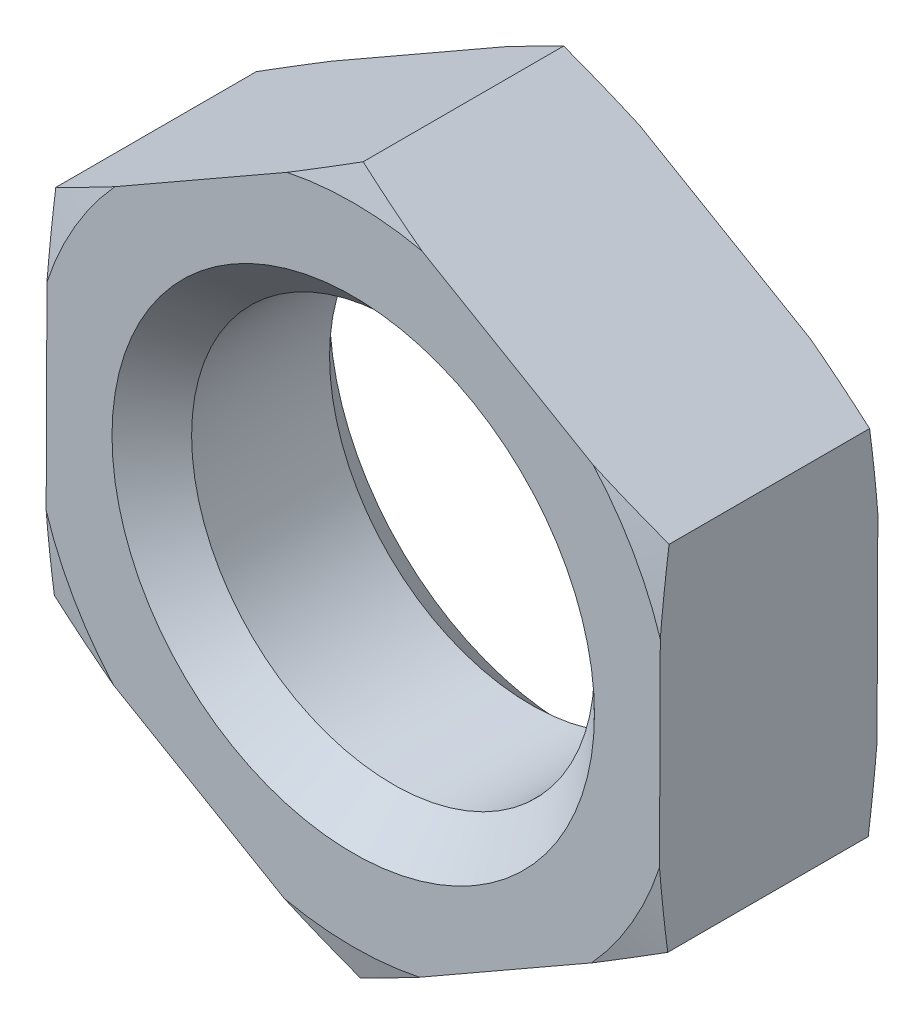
ISO-10303-21;
HEADER;
FILE_DESCRIPTION(('STEP AP214'),'2;1');
FILE_NAME('part.step','',(''),(''),'','','');
FILE_SCHEMA(('AUTOMOTIVE_DESIGN { 1 0 10303 214 1 1 1 1 }'));
ENDSEC;
DATA;
#1=APPLICATION_CONTEXT('core data for automotive mechanical design processes');
#2=APPLICATION_PROTOCOL_DEFINITION('international standard','automotive_design',2000,#1);
#3=PRODUCT_CONTEXT('',#1,'mechanical');
#4=PRODUCT('Part','Part','',(#3));
#5=PRODUCT_RELATED_PRODUCT_CATEGORY('part','',(#4));
#6=PRODUCT_DEFINITION_FORMATION('','',#4);
#7=PRODUCT_DEFINITION_CONTEXT('part definition',#1,'design');
#8=PRODUCT_DEFINITION('design','',#6,#7);
#9=PRODUCT_DEFINITION_SHAPE('','',#8);
#10=(LENGTH_UNIT() NAMED_UNIT(*) SI_UNIT(.MILLI.,.METRE.));
#11=(NAMED_UNIT(*) PLANE_ANGLE_UNIT() SI_UNIT($,.RADIAN.));
#12=(NAMED_UNIT(*) SI_UNIT($,.STERADIAN.) SOLID_ANGLE_UNIT());
#13=UNCERTAINTY_MEASURE_WITH_UNIT(LENGTH_MEASURE(1.E-05),#10,'distance_accuracy_value','');
#14=(GEOMETRIC_REPRESENTATION_CONTEXT(3) GLOBAL_UNCERTAINTY_ASSIGNED_CONTEXT((#13)) GLOBAL_UNIT_ASSIGNED_CONTEXT((#10,
#11,#12)) REPRESENTATION_CONTEXT('',''));
#15=CARTESIAN_POINT('',(0.,0.,0.));
#16=DIRECTION('',(0.,0.,1.));
#17=DIRECTION('',(1.,0.,0.));
#18=AXIS2_PLACEMENT_3D('',#15,#16,#17);
#19=CARTESIAN_POINT('',(3.81479636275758,2.18251087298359,2.7));
#20=DIRECTION('',(-0.503402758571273,-0.86405188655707,0.));
#21=DIRECTION('',(0.864051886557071,-0.503402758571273,0.));
#22=AXIS2_PLACEMENT_3D('',#19,#20,#21);
#23=PLANE('',#22);
#24=CARTESIAN_POINT('',(6.90985807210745,0.379305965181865,1.91751843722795));
#25=CARTESIAN_POINT('',(6.78398320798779,0.452641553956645,1.95011555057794));
#26=CARTESIAN_POINT('',(6.65804093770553,0.526016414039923,1.98236428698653));
#27=CARTESIAN_POINT('',(6.40599521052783,0.672860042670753,2.04602234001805));
#28=CARTESIAN_POINT('',(6.27989175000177,0.746328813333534,2.07743163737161));
#29=CARTESIAN_POINT('',(5.90121963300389,0.966945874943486,2.17020595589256));
#30=CARTESIAN_POINT('',(5.64837803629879,1.11425318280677,2.23009419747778));
#31=CARTESIAN_POINT('',(5.14003529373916,1.41041727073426,2.34465347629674));
#32=CARTESIAN_POINT('',(4.88452770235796,1.55927780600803,2.39928667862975));
#33=CARTESIAN_POINT('',(4.37228600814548,1.8577134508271,2.500360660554));
#34=CARTESIAN_POINT('',(4.11555190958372,2.00728855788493,2.54680146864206));
#35=CARTESIAN_POINT('',(3.60672404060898,2.30373528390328,2.62701781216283));
#36=CARTESIAN_POINT('',(3.3546637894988,2.45058737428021,2.66106643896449));
#37=CARTESIAN_POINT('',(2.97571465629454,2.67136582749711,2.70093332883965));
#38=CARTESIAN_POINT('',(2.84926302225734,2.74503744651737,2.71235425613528));
#39=CARTESIAN_POINT('',(2.59613374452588,2.89251235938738,2.73105232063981));
#40=CARTESIAN_POINT('',(2.46945611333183,2.96631564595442,2.73832968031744));
#41=CARTESIAN_POINT('',(2.21637445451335,3.11376281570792,2.74842676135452));
#42=CARTESIAN_POINT('',(2.08997085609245,3.18740644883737,2.75126073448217));
#43=CARTESIAN_POINT('',(1.83714782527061,3.33470294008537,2.75239331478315));
#44=CARTESIAN_POINT('',(1.71072839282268,3.40835579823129,2.7506919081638));
#45=CARTESIAN_POINT('',(1.45798429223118,3.55560630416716,2.74282748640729));
#46=CARTESIAN_POINT('',(1.33165963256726,3.62920394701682,2.73666411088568));
#47=CARTESIAN_POINT('',(1.07921477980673,3.77628010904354,2.72013138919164));
#48=CARTESIAN_POINT('',(0.953094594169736,3.8497586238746,2.7097618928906));
#49=CARTESIAN_POINT('',(0.663892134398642,4.018250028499,2.68157185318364));
#50=CARTESIAN_POINT('',(0.500904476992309,4.11320779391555,2.66245484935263));
#51=CARTESIAN_POINT('',(0.175497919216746,4.30279196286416,2.61880679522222));
#52=CARTESIAN_POINT('',(0.0130789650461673,4.39741839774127,2.59427627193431));
#53=CARTESIAN_POINT('',(-0.311531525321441,4.58653877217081,2.54074523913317));
#54=CARTESIAN_POINT('',(-0.473721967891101,4.68103207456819,2.51173594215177));
#55=CARTESIAN_POINT('',(-0.797599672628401,4.86972552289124,2.45016706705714));
#56=CARTESIAN_POINT('',(-0.95928691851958,4.96392565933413,2.41760737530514));
#57=CARTESIAN_POINT('',(-1.28487190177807,5.15361378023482,2.34911131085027));
#58=CARTESIAN_POINT('',(-1.44876225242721,5.24909746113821,2.31312820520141));
#59=CARTESIAN_POINT('',(-1.7761518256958,5.43983694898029,2.23885862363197));
#60=CARTESIAN_POINT('',(-1.93965104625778,5.53509275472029,2.20057213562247));
#61=CARTESIAN_POINT('',(-2.26574662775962,5.72507835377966,2.12231197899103));
#62=CARTESIAN_POINT('',(-2.42834414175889,5.81980881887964,2.08234471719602));
#63=CARTESIAN_POINT('',(-2.7532558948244,6.00910471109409,2.00094487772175));
#64=CARTESIAN_POINT('',(-2.91557014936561,6.1036701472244,1.95951238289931));
#65=CARTESIAN_POINT('',(-3.07777338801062,6.19817090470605,1.91751843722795));
#66=B_SPLINE_CURVE_WITH_KNOTS('',3,(#24,#25,#26,#27,#28,#29,#30,#31,#32,#33,#34,#35,#36,#37,#38,
#39,#40,#41,#42,#43,#44,#45,#46,#47,#48,#49,#50,#51,#52,#53,#54,#55,#56,#57,#58,#59,#60,#61,#62,
#63,#64,#65),.UNSPECIFIED.,.F.,.F.,(4,2,2,2,2,2,2,2,2,2,2,2,2,2,2,2,2,2,2,2,4),(0.,
0.447845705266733,0.895701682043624,1.79172967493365,2.69378951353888,3.59584621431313,
4.47660950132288,4.91693652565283,5.3572399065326,5.79612814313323,6.23501771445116,
6.67394273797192,7.11288342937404,7.68157859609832,8.25021842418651,8.81998845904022,
9.38977673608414,9.96893735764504,10.548101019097,11.1252279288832,11.7023222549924),.UNSPECIFIED.);
#67=CARTESIAN_POINT('',(3.81479636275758,2.18251087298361,2.59416006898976));
#68=VERTEX_POINT('',#67);
#69=CARTESIAN_POINT('',(2.97885470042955,2.66953641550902,2.7));
#70=VERTEX_POINT('',#69);
#71=EDGE_CURVE('E169',#68,#70,#66,.T.);
#72=ORIENTED_EDGE('',*,*,#71,.F.);
#73=DIRECTION('',(0.,0.,-1.));
#74=VECTOR('',#73,1.);
#75=CARTESIAN_POINT('',(3.81479636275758,2.18251087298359,2.7));
#76=LINE('',#75,#74);
#77=CARTESIAN_POINT('',(3.81479636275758,2.18251087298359,0.105839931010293));
#78=VERTEX_POINT('',#77);
#79=EDGE_CURVE('E181',#68,#78,#76,.T.);
#80=ORIENTED_EDGE('',*,*,#79,.T.);
#81=CARTESIAN_POINT('',(-3.07777338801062,6.19817090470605,0.782481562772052));
#82=CARTESIAN_POINT('',(-2.95189852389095,6.12483531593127,0.749884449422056));
#83=CARTESIAN_POINT('',(-2.8259562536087,6.05146045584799,0.717635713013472));
#84=CARTESIAN_POINT('',(-2.573910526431,5.90461682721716,0.653977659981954));
#85=CARTESIAN_POINT('',(-2.44780706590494,5.83114805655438,0.622568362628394));
#86=CARTESIAN_POINT('',(-2.06913494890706,5.61053099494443,0.529794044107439));
#87=CARTESIAN_POINT('',(-1.81629335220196,5.46322368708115,0.469905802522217));
#88=CARTESIAN_POINT('',(-1.30795060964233,5.16705959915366,0.35534652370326));
#89=CARTESIAN_POINT('',(-1.05244301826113,5.01819906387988,0.300713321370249));
#90=CARTESIAN_POINT('',(-0.540201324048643,4.71976341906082,0.199639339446));
#91=CARTESIAN_POINT('',(-0.283467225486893,4.57018831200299,0.153198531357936));
#92=CARTESIAN_POINT('',(0.225360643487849,4.27374158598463,0.0729821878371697));
#93=CARTESIAN_POINT('',(0.477420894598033,4.12688949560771,0.038933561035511));
#94=CARTESIAN_POINT('',(0.856370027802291,3.9061110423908,-0.000933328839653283));
#95=CARTESIAN_POINT('',(0.982821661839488,3.83243942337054,-0.0123542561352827));
#96=CARTESIAN_POINT('',(1.23595093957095,3.68496451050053,-0.031052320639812));
#97=CARTESIAN_POINT('',(1.362628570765,3.6111612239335,-0.0383296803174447));
#98=CARTESIAN_POINT('',(1.61571022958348,3.46371405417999,-0.0484267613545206));
#99=CARTESIAN_POINT('',(1.74211382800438,3.39007042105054,-0.051260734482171));
#100=CARTESIAN_POINT('',(1.99493685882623,3.24277392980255,-0.0523933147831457));
#101=CARTESIAN_POINT('',(2.12135629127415,3.16912107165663,-0.050691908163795));
#102=CARTESIAN_POINT('',(2.37410039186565,3.02187056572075,-0.0428274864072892));
#103=CARTESIAN_POINT('',(2.50042505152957,2.9482729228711,-0.0366641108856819));
#104=CARTESIAN_POINT('',(2.7528699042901,2.80119676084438,-0.0201313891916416));
#105=CARTESIAN_POINT('',(2.87899008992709,2.72771824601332,-0.00976189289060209));
#106=CARTESIAN_POINT('',(3.16819254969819,2.55922684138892,0.0184281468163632));
#107=CARTESIAN_POINT('',(3.33118020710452,2.46426907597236,0.037545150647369));
#108=CARTESIAN_POINT('',(3.65658676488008,2.27468490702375,0.0811932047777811));
#109=CARTESIAN_POINT('',(3.81900571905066,2.18005847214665,0.105723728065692));
#110=CARTESIAN_POINT('',(4.14361620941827,1.99093809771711,0.159254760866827));
#111=CARTESIAN_POINT('',(4.30580665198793,1.89644479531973,0.188264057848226));
#112=CARTESIAN_POINT('',(4.62968435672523,1.70775134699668,0.249832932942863));
#113=CARTESIAN_POINT('',(4.79137160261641,1.61355121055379,0.282392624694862));
#114=CARTESIAN_POINT('',(5.1169565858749,1.4238630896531,0.350888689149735));
#115=CARTESIAN_POINT('',(5.28084693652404,1.32837940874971,0.386871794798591));
#116=CARTESIAN_POINT('',(5.60823650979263,1.13763992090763,0.461141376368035));
#117=CARTESIAN_POINT('',(5.77173573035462,1.04238411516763,0.499427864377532));
#118=CARTESIAN_POINT('',(6.09783131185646,0.852398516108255,0.577688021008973));
#119=CARTESIAN_POINT('',(6.26042882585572,0.75766805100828,0.617655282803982));
#120=CARTESIAN_POINT('',(6.58534057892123,0.568372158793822,0.699055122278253));
#121=CARTESIAN_POINT('',(6.74765483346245,0.473806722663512,0.740487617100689));
#122=CARTESIAN_POINT('',(6.90985807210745,0.379305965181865,0.782481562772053));
#123=B_SPLINE_CURVE_WITH_KNOTS('',3,(#81,#82,#83,#84,#85,#86,#87,#88,#89,#90,#91,#92,#93,#94,
#95,#96,#97,#98,#99,#100,#101,#102,#103,#104,#105,#106,#107,#108,#109,#110,#111,#112,#113,#114,
#115,#116,#117,#118,#119,#120,#121,#122),.UNSPECIFIED.,.F.,.F.,(4,2,2,2,2,2,2,2,2,2,2,2,2,2,2,2,
2,2,2,2,4),(0.,0.447845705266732,0.895701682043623,1.79172967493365,2.69378951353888,
3.59584621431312,4.47660950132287,4.91693652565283,5.3572399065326,5.79612814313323,
6.23501771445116,6.67394273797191,7.11288342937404,7.68157859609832,8.25021842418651,
8.81998845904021,9.38977673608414,9.96893735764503,10.548101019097,11.1252279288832,
11.7023222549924),.UNSPECIFIED.);
#124=CARTESIAN_POINT('',(2.97885470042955,2.66953641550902,0.));
#125=VERTEX_POINT('',#124);
#126=EDGE_CURVE('E274',#125,#78,#123,.T.);
#127=ORIENTED_EDGE('',*,*,#126,.F.);
#128=DIRECTION('',(-0.864051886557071,0.503402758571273,0.));
#129=VECTOR('',#128,1.);
#130=CARTESIAN_POINT('',(3.81479636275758,2.18251087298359,0.));
#131=LINE('',#130,#129);
#132=CARTESIAN_POINT('',(0.853229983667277,3.9079404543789,0.));
#133=VERTEX_POINT('',#132);
#134=EDGE_CURVE('E195',#125,#133,#131,.T.);
#135=ORIENTED_EDGE('',*,*,#134,.T.);
#136=CARTESIAN_POINT('',(0.0172883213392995,4.39496599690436,0.10583993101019));
#137=VERTEX_POINT('',#136);
#138=EDGE_CURVE('E199',#137,#133,#123,.T.);
#139=ORIENTED_EDGE('',*,*,#138,.F.);
#140=DIRECTION('',(0.,0.,-1.));
#141=VECTOR('',#140,1.);
#142=CARTESIAN_POINT('',(0.0172883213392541,4.39496599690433,2.7));
#143=LINE('',#142,#141);
#144=CARTESIAN_POINT('',(0.0172883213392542,4.39496599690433,2.59416006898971));
#145=VERTEX_POINT('',#144);
#146=EDGE_CURVE('E222',#145,#137,#143,.T.);
#147=ORIENTED_EDGE('',*,*,#146,.F.);
#148=CARTESIAN_POINT('',(0.853229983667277,3.9079404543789,2.7));
#149=VERTEX_POINT('',#148);
#150=EDGE_CURVE('E347',#149,#145,#66,.T.);
#151=ORIENTED_EDGE('',*,*,#150,.F.);
#152=DIRECTION('',(-0.864051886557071,0.503402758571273,0.));
#153=VECTOR('',#152,1.);
#154=CARTESIAN_POINT('',(3.81479636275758,2.18251087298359,2.7));
#155=LINE('',#154,#153);
#156=EDGE_CURVE('E213',#70,#149,#155,.T.);
#157=ORIENTED_EDGE('',*,*,#156,.F.);
#158=EDGE_LOOP('',(#72,#80,#127,#135,#139,#147,#151,#157));
#159=FACE_BOUND('',#158,.T.);
#160=ADVANCED_FACE('F40',(#159),#23,.F.);
#161=CARTESIAN_POINT('',(0.0172883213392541,4.39496599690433,2.7));
#162=DIRECTION('',(0.496589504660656,-0.867985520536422,0.));
#163=DIRECTION('',(0.867985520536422,0.496589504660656,0.));
#164=AXIS2_PLACEMENT_3D('',#161,#162,#163);
#165=PLANE('',#164);
#166=CARTESIAN_POINT('',(3.11235003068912,6.16570424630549,1.92114962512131));
#167=CARTESIAN_POINT('',(2.98614278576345,6.09349890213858,1.95365696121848));
#168=CARTESIAN_POINT('',(2.85986773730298,6.02125476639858,1.98581515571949));
#169=CARTESIAN_POINT('',(2.60715554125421,5.87667375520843,2.04929043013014));
#170=CARTESIAN_POINT('',(2.48071838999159,5.80433687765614,2.08060749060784));
#171=CARTESIAN_POINT('',(2.10104268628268,5.58711785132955,2.17310243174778));
#172=CARTESIAN_POINT('',(1.84752972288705,5.44207870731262,2.23280071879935));
#173=CARTESIAN_POINT('',(1.33784819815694,5.15048110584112,2.34696764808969));
#174=CARTESIAN_POINT('',(1.08167321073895,5.00391897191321,2.40139868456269));
#175=CARTESIAN_POINT('',(0.568093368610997,4.71009107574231,2.50206274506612));
#176=CARTESIAN_POINT('',(0.310688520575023,4.56282531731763,2.54829581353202));
#177=CARTESIAN_POINT('',(-0.199483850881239,4.27094689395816,2.62810881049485));
#178=CARTESIAN_POINT('',(-0.452217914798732,4.1263533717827,2.66196095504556));
#179=CARTESIAN_POINT('',(-0.832175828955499,3.90897288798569,2.701551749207));
#180=CARTESIAN_POINT('',(-0.958963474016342,3.83643548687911,2.71288375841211));
#181=CARTESIAN_POINT('',(-1.21276363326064,3.69123203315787,2.73141417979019));
#182=CARTESIAN_POINT('',(-1.33977613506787,3.61856598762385,2.73861281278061));
#183=CARTESIAN_POINT('',(-1.59352765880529,3.47339035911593,2.74856684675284));
#184=CARTESIAN_POINT('',(-1.72026625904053,3.40088101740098,2.75133636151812));
#185=CARTESIAN_POINT('',(-1.97375782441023,3.25585411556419,2.75235702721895));
#186=CARTESIAN_POINT('',(-2.10051078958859,3.18333655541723,2.75060816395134));
#187=CARTESIAN_POINT('',(-2.35392073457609,3.03835635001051,2.74266759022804));
#188=CARTESIAN_POINT('',(-2.48057770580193,2.96589370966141,2.73647552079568));
#189=CARTESIAN_POINT('',(-2.73368628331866,2.82108592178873,2.71990418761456));
#190=CARTESIAN_POINT('',(-2.86013788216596,2.74874077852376,2.70952477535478));
#191=CARTESIAN_POINT('',(-3.14972434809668,2.58306336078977,2.68136845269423));
#192=CARTESIAN_POINT('',(-3.31276547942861,2.48978471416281,2.6623156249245));
#193=CARTESIAN_POINT('',(-3.63828108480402,2.30355161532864,2.6188420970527));
#194=CARTESIAN_POINT('',(-3.80075561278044,2.21059713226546,2.59442192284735));
#195=CARTESIAN_POINT('',(-4.12547605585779,2.02481895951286,2.54114608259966));
#196=CARTESIAN_POINT('',(-4.28772089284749,1.93199588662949,2.5122817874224));
#197=CARTESIAN_POINT('',(-4.61170891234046,1.74663674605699,2.45102657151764));
#198=CARTESIAN_POINT('',(-4.7734520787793,1.65410068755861,2.4186355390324));
#199=CARTESIAN_POINT('',(-5.09913770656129,1.46777031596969,2.35049837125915));
#200=CARTESIAN_POINT('',(-5.26307283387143,1.37398019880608,2.31470599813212));
#201=CARTESIAN_POINT('',(-5.59055248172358,1.18662343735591,2.2408290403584));
#202=CARTESIAN_POINT('',(-5.75409700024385,1.09305679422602,2.20274444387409));
#203=CARTESIAN_POINT('',(-6.08028880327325,0.906436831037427,2.12489321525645));
#204=CARTESIAN_POINT('',(-6.24293722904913,0.813382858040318,2.08513290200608));
#205=CARTESIAN_POINT('',(-6.56795073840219,0.627437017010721,2.00415163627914));
#206=CARTESIAN_POINT('',(-6.73031583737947,0.534545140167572,1.96293076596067));
#207=CARTESIAN_POINT('',(-6.89256975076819,0.441716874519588,1.92114962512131));
#208=B_SPLINE_CURVE_WITH_KNOTS('',3,(#166,#167,#168,#169,#170,#171,#172,#173,#174,#175,#176,
#177,#178,#179,#180,#181,#182,#183,#184,#185,#186,#187,#188,#189,#190,#191,#192,#193,#194,#195,
#196,#197,#198,#199,#200,#201,#202,#203,#204,#205,#206,#207),.UNSPECIFIED.,.F.,.F.,(4,2,2,2,2,2,
2,2,2,2,2,2,2,2,2,2,2,2,2,2,4),(0.,0.446975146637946,0.893960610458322,1.78824983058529,
2.68851406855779,3.58877342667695,4.46784236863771,4.90732297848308,5.34678010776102,
5.78483405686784,6.22288938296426,6.66098010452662,7.09908636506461,7.6653958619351,
8.23164989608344,8.79901762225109,9.36640333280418,9.94307587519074,10.5197513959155,
11.0944188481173,11.6690540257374),.UNSPECIFIED.);
#209=CARTESIAN_POINT('',(-0.822459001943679,3.91453205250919,2.7));
#210=VERTEX_POINT('',#209);
#211=EDGE_CURVE('E331',#145,#210,#208,.T.);
#212=ORIENTED_EDGE('',*,*,#211,.F.);
#213=ORIENTED_EDGE('',*,*,#146,.T.);
#214=CARTESIAN_POINT('',(-6.89256975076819,0.441716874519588,0.778850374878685));
#215=CARTESIAN_POINT('',(-6.76636250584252,0.513922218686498,0.746343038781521));
#216=CARTESIAN_POINT('',(-6.64008745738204,0.586166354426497,0.714184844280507));
#217=CARTESIAN_POINT('',(-6.38737526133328,0.730747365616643,0.650709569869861));
#218=CARTESIAN_POINT('',(-6.26093811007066,0.80308424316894,0.61939250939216));
#219=CARTESIAN_POINT('',(-5.88126240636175,1.02030326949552,0.526897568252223));
#220=CARTESIAN_POINT('',(-5.62774944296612,1.16534241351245,0.467199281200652));
#221=CARTESIAN_POINT('',(-5.11806791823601,1.45694001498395,0.353032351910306));
#222=CARTESIAN_POINT('',(-4.86189293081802,1.60350214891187,0.298601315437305));
#223=CARTESIAN_POINT('',(-4.34831308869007,1.89733004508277,0.197937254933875));
#224=CARTESIAN_POINT('',(-4.09090824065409,2.04459580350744,0.151704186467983));
#225=CARTESIAN_POINT('',(-3.58073586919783,2.33647422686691,0.0718911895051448));
#226=CARTESIAN_POINT('',(-3.32800180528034,2.48106774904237,0.0380390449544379));
#227=CARTESIAN_POINT('',(-2.94804389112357,2.69844823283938,-0.00155174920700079));
#228=CARTESIAN_POINT('',(-2.82125624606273,2.77098563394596,-0.0128837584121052));
#229=CARTESIAN_POINT('',(-2.56745608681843,2.91618908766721,-0.0314141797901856));
#230=CARTESIAN_POINT('',(-2.4404435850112,2.98885513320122,-0.0386128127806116));
#231=CARTESIAN_POINT('',(-2.18669206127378,3.13403076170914,-0.0485668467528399));
#232=CARTESIAN_POINT('',(-2.05995346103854,3.20654010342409,-0.0513363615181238));
#233=CARTESIAN_POINT('',(-1.80646189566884,3.35156700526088,-0.0523570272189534));
#234=CARTESIAN_POINT('',(-1.67970893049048,3.42408456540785,-0.0506081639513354));
#235=CARTESIAN_POINT('',(-1.42629898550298,3.56906477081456,-0.0426675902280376));
#236=CARTESIAN_POINT('',(-1.29964201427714,3.64152741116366,-0.0364755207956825));
#237=CARTESIAN_POINT('',(-1.04653343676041,3.78633519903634,-0.0199041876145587));
#238=CARTESIAN_POINT('',(-0.920081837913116,3.85868034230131,-0.00952477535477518));
#239=CARTESIAN_POINT('',(-0.630495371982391,4.02435776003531,0.0186315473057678));
#240=CARTESIAN_POINT('',(-0.46745424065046,4.11763640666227,0.0376843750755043));
#241=CARTESIAN_POINT('',(-0.141938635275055,4.30386950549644,0.0811579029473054));
#242=CARTESIAN_POINT('',(0.0205358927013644,4.39682398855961,0.105578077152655));
#243=CARTESIAN_POINT('',(0.345256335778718,4.58260216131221,0.158853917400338));
#244=CARTESIAN_POINT('',(0.507501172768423,4.67542523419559,0.187718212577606));
#245=CARTESIAN_POINT('',(0.831489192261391,4.86078437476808,0.248973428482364));
#246=CARTESIAN_POINT('',(0.993232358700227,4.95332043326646,0.281364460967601));
#247=CARTESIAN_POINT('',(1.31891798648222,5.13965080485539,0.349501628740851));
#248=CARTESIAN_POINT('',(1.48285311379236,5.23344092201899,0.385294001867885));
#249=CARTESIAN_POINT('',(1.81033276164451,5.42079768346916,0.459170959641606));
#250=CARTESIAN_POINT('',(1.97387728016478,5.51436432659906,0.497255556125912));
#251=CARTESIAN_POINT('',(2.30006908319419,5.70098428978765,0.575106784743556));
#252=CARTESIAN_POINT('',(2.46271750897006,5.79403826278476,0.614867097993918));
#253=CARTESIAN_POINT('',(2.78773101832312,5.97998410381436,0.695848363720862));
#254=CARTESIAN_POINT('',(2.9500961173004,6.0728759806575,0.737069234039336));
#255=CARTESIAN_POINT('',(3.11235003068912,6.16570424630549,0.778850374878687));
#256=B_SPLINE_CURVE_WITH_KNOTS('',3,(#214,#215,#216,#217,#218,#219,#220,#221,#222,#223,#224,
#225,#226,#227,#228,#229,#230,#231,#232,#233,#234,#235,#236,#237,#238,#239,#240,#241,#242,#243,
#244,#245,#246,#247,#248,#249,#250,#251,#252,#253,#254,#255),.UNSPECIFIED.,.F.,.F.,(4,2,2,2,2,2,
2,2,2,2,2,2,2,2,2,2,2,2,2,2,4),(0.,0.446975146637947,0.89396061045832,1.78824983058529,
2.68851406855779,3.58877342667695,4.4678423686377,4.90732297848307,5.34678010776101,
5.78483405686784,6.22288938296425,6.66098010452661,7.09908636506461,7.6653958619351,
8.23164989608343,8.79901762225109,9.36640333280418,9.94307587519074,10.5197513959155,
11.0944188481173,11.6690540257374),.UNSPECIFIED.);
#257=CARTESIAN_POINT('',(-0.822459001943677,3.91453205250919,0.));
#258=VERTEX_POINT('',#257);
#259=EDGE_CURVE('E459',#258,#137,#256,.T.);
#260=ORIENTED_EDGE('',*,*,#259,.F.);
#261=DIRECTION('',(-0.867985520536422,-0.496589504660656,0.));
#262=VECTOR('',#261,1.);
#263=CARTESIAN_POINT('',(0.0172883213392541,4.39496599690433,0.));
#264=LINE('',#263,#262);
#265=CARTESIAN_POINT('',(-2.9577607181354,2.69288906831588,0.));
#266=VERTEX_POINT('',#265);
#267=EDGE_CURVE('E198',#258,#266,#264,.T.);
#268=ORIENTED_EDGE('',*,*,#267,.T.);
#269=CARTESIAN_POINT('',(-3.79750804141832,2.21245512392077,0.105839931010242));
#270=VERTEX_POINT('',#269);
#271=EDGE_CURVE('E255',#270,#266,#256,.T.);
#272=ORIENTED_EDGE('',*,*,#271,.F.);
#273=DIRECTION('',(0.,0.,-1.));
#274=VECTOR('',#273,1.);
#275=CARTESIAN_POINT('',(-3.79750804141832,2.21245512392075,2.7));
#276=LINE('',#275,#274);
#277=CARTESIAN_POINT('',(-3.79750804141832,2.21245512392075,2.59416006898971));
#278=VERTEX_POINT('',#277);
#279=EDGE_CURVE('E220',#278,#270,#276,.T.);
#280=ORIENTED_EDGE('',*,*,#279,.F.);
#281=CARTESIAN_POINT('',(-2.9577607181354,2.69288906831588,2.7));
#282=VERTEX_POINT('',#281);
#283=EDGE_CURVE('E326',#282,#278,#208,.T.);
#284=ORIENTED_EDGE('',*,*,#283,.F.);
#285=DIRECTION('',(-0.867985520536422,-0.496589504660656,0.));
#286=VECTOR('',#285,1.);
#287=CARTESIAN_POINT('',(0.0172883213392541,4.39496599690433,2.7));
#288=LINE('',#287,#286);
#289=EDGE_CURVE('E363',#210,#282,#288,.T.);
#290=ORIENTED_EDGE('',*,*,#289,.F.);
#291=EDGE_LOOP('',(#212,#213,#260,#268,#272,#280,#284,#290));
#292=FACE_BOUND('',#291,.T.);
#293=ADVANCED_FACE('F333',(#292),#165,.F.);
#294=CARTESIAN_POINT('',(-3.79750804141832,2.21245512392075,2.7));
#295=DIRECTION('',(0.999992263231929,-0.00393363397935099,0.));
#296=DIRECTION('',(0.00393363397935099,0.999992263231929,0.));
#297=AXIS2_PLACEMENT_3D('',#294,#295,#296);
#298=PLANE('',#297);
#299=CARTESIAN_POINT('',(-3.78533310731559,5.30751683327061,2.02501295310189));
#300=CARTESIAN_POINT('',(-3.78587387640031,5.17004473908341,2.05491529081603));
#301=CARTESIAN_POINT('',(-3.78641496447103,5.03249155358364,2.08444505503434));
#302=CARTESIAN_POINT('',(-3.78749789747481,4.75719277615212,2.14261201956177));
#303=CARTESIAN_POINT('',(-3.78803974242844,4.6194471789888,2.17124919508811));
#304=CARTESIAN_POINT('',(-3.78966703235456,4.20576422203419,2.25562345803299));
#305=CARTESIAN_POINT('',(-3.79075374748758,3.92950396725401,2.30979619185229));
#306=CARTESIAN_POINT('',(-3.79293718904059,3.37443842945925,2.41255902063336));
#307=CARTESIAN_POINT('',(-3.79403393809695,3.09562739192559,2.46111844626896));
#308=CARTESIAN_POINT('',(-3.79623267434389,2.53667369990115,2.54989503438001));
#309=CARTESIAN_POINT('',(-3.79733466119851,2.25653113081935,2.59011272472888));
#310=CARTESIAN_POINT('',(-3.79952061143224,1.70082784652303,2.65828273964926));
#311=CARTESIAN_POINT('',(-3.80060445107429,1.42529858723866,2.68648084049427));
#312=CARTESIAN_POINT('',(-3.80223331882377,1.01121452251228,2.71817414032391));
#313=CARTESIAN_POINT('',(-3.80277677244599,0.873059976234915,2.72697113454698));
#314=CARTESIAN_POINT('',(-3.80386441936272,0.596562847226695,2.7407374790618));
#315=CARTESIAN_POINT('',(-3.80440861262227,0.458220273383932,2.74570700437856));
#316=CARTESIAN_POINT('',(-3.80549592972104,0.181806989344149,2.75161972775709));
#317=CARTESIAN_POINT('',(-3.80603905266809,0.0437365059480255,2.75257334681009));
#318=CARTESIAN_POINT('',(-3.80712516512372,-0.232370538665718,2.75045290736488));
#319=CARTESIAN_POINT('',(-3.80766815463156,-0.370407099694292,2.74737882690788));
#320=CARTESIAN_POINT('',(-3.80929634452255,-0.784318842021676,2.73225507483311));
#321=CARTESIAN_POINT('',(-3.81038076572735,-1.05999594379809,2.71430388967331));
#322=CARTESIAN_POINT('',(-3.8121110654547,-1.49986562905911,2.67492480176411));
#323=CARTESIAN_POINT('',(-3.81275856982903,-1.66447152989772,2.6577715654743));
#324=CARTESIAN_POINT('',(-3.81405162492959,-1.99318668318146,2.61936620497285));
#325=CARTESIAN_POINT('',(-3.8146971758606,-2.15729598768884,2.59811452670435));
#326=CARTESIAN_POINT('',(-3.81663275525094,-2.64935102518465,2.52916164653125));
#327=CARTESIAN_POINT('',(-3.8179199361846,-2.97657287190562,2.4763066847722));
#328=CARTESIAN_POINT('',(-3.81985470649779,-3.4684222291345,2.38969130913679));
#329=CARTESIAN_POINT('',(-3.82050477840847,-3.63368083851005,2.35936300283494));
#330=CARTESIAN_POINT('',(-3.82180347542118,-3.9638302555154,2.29674943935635));
#331=CARTESIAN_POINT('',(-3.82245210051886,-4.1287210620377,2.26446417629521));
#332=CARTESIAN_POINT('',(-3.82374644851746,-4.45776489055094,2.19838833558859));
#333=CARTESIAN_POINT('',(-3.82439217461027,-4.62191872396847,2.16460176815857));
#334=CARTESIAN_POINT('',(-3.82568251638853,-4.94994410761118,2.09572074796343));
#335=CARTESIAN_POINT('',(-3.82632713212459,-5.11381567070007,2.06062635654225));
#336=CARTESIAN_POINT('',(-3.8269712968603,-5.27757258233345,2.02501295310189));
#337=B_SPLINE_CURVE_WITH_KNOTS('',3,(#299,#300,#301,#302,#303,#304,#305,#306,#307,#308,#309,
#310,#311,#312,#313,#314,#315,#316,#317,#318,#319,#320,#321,#322,#323,#324,#325,#326,#327,#328,
#329,#330,#331,#332,#333,#334,#335,#336),.UNSPECIFIED.,.F.,.F.,(4,2,2,2,2,2,2,2,2,2,2,2,2,2,2,2,
2,2,4),(0.,0.422062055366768,0.844135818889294,1.6886619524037,2.53760363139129,
3.38649157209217,4.21707510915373,4.63233588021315,5.04757766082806,5.46174125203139,
5.87590710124,6.70423921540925,7.20069136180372,7.6970895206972,8.69124408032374,
9.19529928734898,9.69935601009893,10.2021389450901,10.7048983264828),.UNSPECIFIED.);
#338=CARTESIAN_POINT('',(-3.80131370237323,1.24499563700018,2.7));
#339=VERTEX_POINT('',#338);
#340=EDGE_CURVE('E325',#278,#339,#337,.T.);
#341=ORIENTED_EDGE('',*,*,#340,.F.);
#342=ORIENTED_EDGE('',*,*,#279,.T.);
#343=CARTESIAN_POINT('',(-3.8269712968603,-5.27757258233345,0.674987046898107));
#344=CARTESIAN_POINT('',(-3.82643052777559,-5.14010048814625,0.645084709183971));
#345=CARTESIAN_POINT('',(-3.82588943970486,-5.00254730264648,0.61555494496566));
#346=CARTESIAN_POINT('',(-3.82480650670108,-4.72724852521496,0.55738798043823));
#347=CARTESIAN_POINT('',(-3.82426466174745,-4.58950292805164,0.528750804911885));
#348=CARTESIAN_POINT('',(-3.82263737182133,-4.17581997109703,0.444376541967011));
#349=CARTESIAN_POINT('',(-3.82155065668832,-3.89955971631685,0.390203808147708));
#350=CARTESIAN_POINT('',(-3.8193672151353,-3.34449417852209,0.287440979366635));
#351=CARTESIAN_POINT('',(-3.81827046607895,-3.06568314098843,0.238881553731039));
#352=CARTESIAN_POINT('',(-3.816071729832,-2.50672944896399,0.150104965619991));
#353=CARTESIAN_POINT('',(-3.81496974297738,-2.22658687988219,0.109887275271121));
#354=CARTESIAN_POINT('',(-3.81278379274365,-1.67088359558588,0.041717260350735));
#355=CARTESIAN_POINT('',(-3.81169995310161,-1.3953543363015,0.0135191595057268));
#356=CARTESIAN_POINT('',(-3.81007108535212,-0.981270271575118,-0.0181741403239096));
#357=CARTESIAN_POINT('',(-3.8095276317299,-0.843115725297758,-0.0269711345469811));
#358=CARTESIAN_POINT('',(-3.80843998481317,-0.566618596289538,-0.0407374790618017));
#359=CARTESIAN_POINT('',(-3.80789579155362,-0.428276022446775,-0.0457070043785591));
#360=CARTESIAN_POINT('',(-3.80680847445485,-0.151862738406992,-0.0516197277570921));
#361=CARTESIAN_POINT('',(-3.80626535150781,-0.0137922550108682,-0.0525733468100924));
#362=CARTESIAN_POINT('',(-3.80517923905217,0.262314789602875,-0.0504529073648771));
#363=CARTESIAN_POINT('',(-3.80463624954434,0.400351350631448,-0.0473788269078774));
#364=CARTESIAN_POINT('',(-3.80300805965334,0.814263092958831,-0.0322550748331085));
#365=CARTESIAN_POINT('',(-3.80192363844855,1.08994019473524,-0.0143038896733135));
#366=CARTESIAN_POINT('',(-3.80019333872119,1.52980987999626,0.0250751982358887));
#367=CARTESIAN_POINT('',(-3.79954583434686,1.69441578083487,0.0422284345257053));
#368=CARTESIAN_POINT('',(-3.7982527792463,2.02313093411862,0.0806337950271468));
#369=CARTESIAN_POINT('',(-3.79760722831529,2.187240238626,0.101885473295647));
#370=CARTESIAN_POINT('',(-3.79567164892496,2.67929527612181,0.170838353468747));
#371=CARTESIAN_POINT('',(-3.79438446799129,3.00651712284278,0.223693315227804));
#372=CARTESIAN_POINT('',(-3.7924496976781,3.49836648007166,0.310308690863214));
#373=CARTESIAN_POINT('',(-3.79179962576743,3.66362508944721,0.34063699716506));
#374=CARTESIAN_POINT('',(-3.79050092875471,3.99377450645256,0.403250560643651));
#375=CARTESIAN_POINT('',(-3.78985230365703,4.15866531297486,0.435535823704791));
#376=CARTESIAN_POINT('',(-3.78855795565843,4.4877091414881,0.501611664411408));
#377=CARTESIAN_POINT('',(-3.78791222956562,4.65186297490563,0.535398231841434));
#378=CARTESIAN_POINT('',(-3.78662188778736,4.97988835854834,0.604279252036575));
#379=CARTESIAN_POINT('',(-3.7859772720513,5.14375992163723,0.639373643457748));
#380=CARTESIAN_POINT('',(-3.78533310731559,5.30751683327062,0.674987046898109));
#381=B_SPLINE_CURVE_WITH_KNOTS('',3,(#343,#344,#345,#346,#347,#348,#349,#350,#351,#352,#353,
#354,#355,#356,#357,#358,#359,#360,#361,#362,#363,#364,#365,#366,#367,#368,#369,#370,#371,#372,
#373,#374,#375,#376,#377,#378,#379,#380),.UNSPECIFIED.,.F.,.F.,(4,2,2,2,2,2,2,2,2,2,2,2,2,2,2,2,
2,2,4),(0.,0.422062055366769,0.844135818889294,1.6886619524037,2.53760363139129,
3.38649157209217,4.21707510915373,4.63233588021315,5.04757766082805,5.46174125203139,
5.87590710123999,6.70423921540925,7.20069136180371,7.6970895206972,8.69124408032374,
9.19529928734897,9.69935601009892,10.2021389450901,10.7048983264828),.UNSPECIFIED.);
#382=CARTESIAN_POINT('',(-3.80131370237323,1.24499563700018,0.));
#383=VERTEX_POINT('',#382);
#384=EDGE_CURVE('E454',#383,#270,#381,.T.);
#385=ORIENTED_EDGE('',*,*,#384,.F.);
#386=DIRECTION('',(-0.00393363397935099,-0.999992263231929,0.));
#387=VECTOR('',#386,1.);
#388=CARTESIAN_POINT('',(-3.79750804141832,2.21245512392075,0.));
#389=LINE('',#388,#387);
#390=CARTESIAN_POINT('',(-3.81099070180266,-1.21505138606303,0.));
#391=VERTEX_POINT('',#390);
#392=EDGE_CURVE('E202',#383,#391,#389,.T.);
#393=ORIENTED_EDGE('',*,*,#392,.T.);
#394=CARTESIAN_POINT('',(-3.81479636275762,-2.18251087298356,0.105839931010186));
#395=VERTEX_POINT('',#394);
#396=EDGE_CURVE('E289',#395,#391,#381,.T.);
#397=ORIENTED_EDGE('',*,*,#396,.F.);
#398=DIRECTION('',(0.,0.,-1.));
#399=VECTOR('',#398,1.);
#400=CARTESIAN_POINT('',(-3.81479636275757,-2.18251087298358,2.7));
#401=LINE('',#400,#399);
#402=CARTESIAN_POINT('',(-3.81479636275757,-2.18251087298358,2.59416006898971));
#403=VERTEX_POINT('',#402);
#404=EDGE_CURVE('E218',#403,#395,#401,.T.);
#405=ORIENTED_EDGE('',*,*,#404,.F.);
#406=CARTESIAN_POINT('',(-3.81099070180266,-1.21505138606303,2.7));
#407=VERTEX_POINT('',#406);
#408=EDGE_CURVE('E319',#407,#403,#337,.T.);
#409=ORIENTED_EDGE('',*,*,#408,.F.);
#410=DIRECTION('',(-0.00393363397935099,-0.999992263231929,0.));
#411=VECTOR('',#410,1.);
#412=CARTESIAN_POINT('',(-3.79750804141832,2.21245512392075,2.7));
#413=LINE('',#412,#411);
#414=EDGE_CURVE('E367',#339,#407,#413,.T.);
#415=ORIENTED_EDGE('',*,*,#414,.F.);
#416=EDGE_LOOP('',(#341,#342,#385,#393,#397,#405,#409,#415));
#417=FACE_BOUND('',#416,.T.);
#418=ADVANCED_FACE('F299',(#417),#298,.F.);
#419=CARTESIAN_POINT('',(-3.81479636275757,-2.18251087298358,2.7));
#420=DIRECTION('',(0.503402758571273,0.86405188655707,0.));
#421=DIRECTION('',(-0.86405188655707,0.503402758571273,0.));
#422=AXIS2_PLACEMENT_3D('',#419,#420,#421);
#423=PLANE('',#422);
#424=CARTESIAN_POINT('',(-6.90985807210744,-0.379305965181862,1.91751843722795));
#425=CARTESIAN_POINT('',(-6.78398320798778,-0.452641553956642,1.95011555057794));
#426=CARTESIAN_POINT('',(-6.65804093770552,-0.52601641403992,1.98236428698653));
#427=CARTESIAN_POINT('',(-6.40599521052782,-0.67286004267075,2.04602234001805));
#428=CARTESIAN_POINT('',(-6.27989175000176,-0.746328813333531,2.07743163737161));
#429=CARTESIAN_POINT('',(-5.90121963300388,-0.966945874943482,2.17020595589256));
#430=CARTESIAN_POINT('',(-5.64837803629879,-1.11425318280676,2.23009419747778));
#431=CARTESIAN_POINT('',(-5.14003529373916,-1.41041727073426,2.34465347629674));
#432=CARTESIAN_POINT('',(-4.88452770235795,-1.55927780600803,2.39928667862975));
#433=CARTESIAN_POINT('',(-4.37228600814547,-1.85771345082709,2.500360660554));
#434=CARTESIAN_POINT('',(-4.11555190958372,-2.00728855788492,2.54680146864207));
#435=CARTESIAN_POINT('',(-3.60672404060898,-2.30373528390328,2.62701781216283));
#436=CARTESIAN_POINT('',(-3.3546637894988,-2.45058737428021,2.66106643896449));
#437=CARTESIAN_POINT('',(-2.97571465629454,-2.67136582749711,2.70093332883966));
#438=CARTESIAN_POINT('',(-2.84926302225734,-2.74503744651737,2.71235425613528));
#439=CARTESIAN_POINT('',(-2.59613374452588,-2.89251235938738,2.73105232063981));
#440=CARTESIAN_POINT('',(-2.46945611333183,-2.96631564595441,2.73832968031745));
#441=CARTESIAN_POINT('',(-2.21637445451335,-3.11376281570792,2.74842676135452));
#442=CARTESIAN_POINT('',(-2.08997085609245,-3.18740644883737,2.75126073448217));
#443=CARTESIAN_POINT('',(-1.8371478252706,-3.33470294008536,2.75239331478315));
#444=CARTESIAN_POINT('',(-1.71072839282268,-3.40835579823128,2.7506919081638));
#445=CARTESIAN_POINT('',(-1.45798429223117,-3.55560630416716,2.74282748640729));
#446=CARTESIAN_POINT('',(-1.33165963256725,-3.62920394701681,2.73666411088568));
#447=CARTESIAN_POINT('',(-1.07921477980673,-3.77628010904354,2.72013138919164));
#448=CARTESIAN_POINT('',(-0.953094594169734,-3.84975862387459,2.7097618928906));
#449=CARTESIAN_POINT('',(-0.66389213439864,-4.01825002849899,2.68157185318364));
#450=CARTESIAN_POINT('',(-0.500904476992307,-4.11320779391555,2.66245484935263));
#451=CARTESIAN_POINT('',(-0.175497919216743,-4.30279196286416,2.61880679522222));
#452=CARTESIAN_POINT('',(-0.0130789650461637,-4.39741839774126,2.59427627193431));
#453=CARTESIAN_POINT('',(0.311531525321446,-4.58653877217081,2.54074523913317));
#454=CARTESIAN_POINT('',(0.473721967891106,-4.68103207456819,2.51173594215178));
#455=CARTESIAN_POINT('',(0.797599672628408,-4.86972552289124,2.45016706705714));
#456=CARTESIAN_POINT('',(0.959286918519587,-4.96392565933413,2.41760737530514));
#457=CARTESIAN_POINT('',(1.28487190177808,-5.15361378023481,2.34911131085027));
#458=CARTESIAN_POINT('',(1.44876225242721,-5.24909746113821,2.31312820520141));
#459=CARTESIAN_POINT('',(1.7761518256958,-5.43983694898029,2.23885862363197));
#460=CARTESIAN_POINT('',(1.93965104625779,-5.53509275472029,2.20057213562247));
#461=CARTESIAN_POINT('',(2.26574662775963,-5.72507835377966,2.12231197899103));
#462=CARTESIAN_POINT('',(2.4283441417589,-5.81980881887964,2.08234471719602));
#463=CARTESIAN_POINT('',(2.75325589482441,-6.0091047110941,2.00094487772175));
#464=CARTESIAN_POINT('',(2.91557014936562,-6.10367014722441,1.95951238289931));
#465=CARTESIAN_POINT('',(3.07777338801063,-6.19817090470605,1.91751843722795));
#466=B_SPLINE_CURVE_WITH_KNOTS('',3,(#424,#425,#426,#427,#428,#429,#430,#431,#432,#433,#434,
#435,#436,#437,#438,#439,#440,#441,#442,#443,#444,#445,#446,#447,#448,#449,#450,#451,#452,#453,
#454,#455,#456,#457,#458,#459,#460,#461,#462,#463,#464,#465),.UNSPECIFIED.,.F.,.F.,(4,2,2,2,2,2,
2,2,2,2,2,2,2,2,2,2,2,2,2,2,4),(0.,0.447845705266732,0.895701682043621,1.79172967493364,
2.69378951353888,3.59584621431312,4.47660950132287,4.91693652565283,5.35723990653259,
5.79612814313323,6.23501771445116,6.67394273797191,7.11288342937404,7.68157859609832,
8.25021842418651,8.81998845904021,9.38977673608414,9.96893735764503,10.5481010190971,
11.1252279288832,11.7023222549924),.UNSPECIFIED.);
#467=CARTESIAN_POINT('',(-2.97885470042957,-2.66953641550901,2.7));
#468=VERTEX_POINT('',#467);
#469=EDGE_CURVE('E312',#403,#468,#466,.T.);
#470=ORIENTED_EDGE('',*,*,#469,.F.);
#471=ORIENTED_EDGE('',*,*,#404,.T.);
#472=CARTESIAN_POINT('',(3.07777338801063,-6.19817090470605,0.782481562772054));
#473=CARTESIAN_POINT('',(2.95189852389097,-6.12483531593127,0.749884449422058));
#474=CARTESIAN_POINT('',(2.82595625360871,-6.05146045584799,0.717635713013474));
#475=CARTESIAN_POINT('',(2.57391052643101,-5.90461682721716,0.653977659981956));
#476=CARTESIAN_POINT('',(2.44780706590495,-5.83114805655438,0.622568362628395));
#477=CARTESIAN_POINT('',(2.06913494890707,-5.61053099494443,0.52979404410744));
#478=CARTESIAN_POINT('',(1.81629335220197,-5.46322368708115,0.469905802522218));
#479=CARTESIAN_POINT('',(1.30795060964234,-5.16705959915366,0.35534652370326));
#480=CARTESIAN_POINT('',(1.05244301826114,-5.01819906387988,0.300713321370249));
#481=CARTESIAN_POINT('',(0.540201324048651,-4.71976341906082,0.199639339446));
#482=CARTESIAN_POINT('',(0.283467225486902,-4.57018831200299,0.153198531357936));
#483=CARTESIAN_POINT('',(-0.22536064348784,-4.27374158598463,0.0729821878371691));
#484=CARTESIAN_POINT('',(-0.477420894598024,-4.1268894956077,0.0389335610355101));
#485=CARTESIAN_POINT('',(-0.856370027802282,-3.9061110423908,-0.000933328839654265));
#486=CARTESIAN_POINT('',(-0.982821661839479,-3.83243942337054,-0.0123542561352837));
#487=CARTESIAN_POINT('',(-1.23595093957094,-3.68496451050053,-0.0310523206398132));
#488=CARTESIAN_POINT('',(-1.36262857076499,-3.6111612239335,-0.0383296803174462));
#489=CARTESIAN_POINT('',(-1.61571022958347,-3.46371405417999,-0.0484267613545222));
#490=CARTESIAN_POINT('',(-1.74211382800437,-3.39007042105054,-0.0512607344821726));
#491=CARTESIAN_POINT('',(-1.99493685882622,-3.24277392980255,-0.0523933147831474));
#492=CARTESIAN_POINT('',(-2.12135629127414,-3.16912107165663,-0.0506919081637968));
#493=CARTESIAN_POINT('',(-2.37410039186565,-3.02187056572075,-0.0428274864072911));
#494=CARTESIAN_POINT('',(-2.50042505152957,-2.9482729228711,-0.0366641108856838));
#495=CARTESIAN_POINT('',(-2.75286990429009,-2.80119676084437,-0.0201313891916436));
#496=CARTESIAN_POINT('',(-2.87899008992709,-2.72771824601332,-0.00976189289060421));
#497=CARTESIAN_POINT('',(-3.16819254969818,-2.55922684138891,0.018428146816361));
#498=CARTESIAN_POINT('',(-3.33118020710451,-2.46426907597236,0.0375451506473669));
#499=CARTESIAN_POINT('',(-3.65658676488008,-2.27468490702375,0.0811932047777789));
#500=CARTESIAN_POINT('',(-3.81900571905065,-2.18005847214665,0.105723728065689));
#501=CARTESIAN_POINT('',(-4.14361620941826,-1.9909380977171,0.159254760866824));
#502=CARTESIAN_POINT('',(-4.30580665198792,-1.89644479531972,0.188264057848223));
#503=CARTESIAN_POINT('',(-4.62968435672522,-1.70775134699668,0.249832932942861));
#504=CARTESIAN_POINT('',(-4.7913716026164,-1.61355121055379,0.28239262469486));
#505=CARTESIAN_POINT('',(-5.11695658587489,-1.4238630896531,0.350888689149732));
#506=CARTESIAN_POINT('',(-5.28084693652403,-1.32837940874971,0.386871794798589));
#507=CARTESIAN_POINT('',(-5.60823650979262,-1.13763992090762,0.461141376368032));
#508=CARTESIAN_POINT('',(-5.77173573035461,-1.04238411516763,0.499427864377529));
#509=CARTESIAN_POINT('',(-6.09783131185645,-0.852398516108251,0.577688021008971));
#510=CARTESIAN_POINT('',(-6.26042882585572,-0.757668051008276,0.617655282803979));
#511=CARTESIAN_POINT('',(-6.58534057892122,-0.568372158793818,0.69905512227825));
#512=CARTESIAN_POINT('',(-6.74765483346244,-0.473806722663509,0.740487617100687));
#513=CARTESIAN_POINT('',(-6.90985807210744,-0.379305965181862,0.78248156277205));
#514=B_SPLINE_CURVE_WITH_KNOTS('',3,(#472,#473,#474,#475,#476,#477,#478,#479,#480,#481,#482,
#483,#484,#485,#486,#487,#488,#489,#490,#491,#492,#493,#494,#495,#496,#497,#498,#499,#500,#501,
#502,#503,#504,#505,#506,#507,#508,#509,#510,#511,#512,#513),.UNSPECIFIED.,.F.,.F.,(4,2,2,2,2,2,
2,2,2,2,2,2,2,2,2,2,2,2,2,2,4),(0.,0.447845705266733,0.895701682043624,1.79172967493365,
2.69378951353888,3.59584621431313,4.47660950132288,4.91693652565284,5.3572399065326,
5.79612814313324,6.23501771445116,6.67394273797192,7.11288342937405,7.68157859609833,
8.25021842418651,8.81998845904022,9.38977673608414,9.96893735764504,10.5481010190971,
11.1252279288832,11.7023222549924),.UNSPECIFIED.);
#515=CARTESIAN_POINT('',(-2.97885470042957,-2.66953641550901,0.));
#516=VERTEX_POINT('',#515);
#517=EDGE_CURVE('E287',#516,#395,#514,.T.);
#518=ORIENTED_EDGE('',*,*,#517,.F.);
#519=DIRECTION('',(0.86405188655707,-0.503402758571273,0.));
#520=VECTOR('',#519,1.);
#521=CARTESIAN_POINT('',(-3.81479636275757,-2.18251087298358,0.));
#522=LINE('',#521,#520);
#523=CARTESIAN_POINT('',(-0.853229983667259,-3.9079404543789,0.));
#524=VERTEX_POINT('',#523);
#525=EDGE_CURVE('E205',#516,#524,#522,.T.);
#526=ORIENTED_EDGE('',*,*,#525,.T.);
#527=CARTESIAN_POINT('',(-0.0172883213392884,-4.39496599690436,0.10583993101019));
#528=VERTEX_POINT('',#527);
#529=EDGE_CURVE('E281',#528,#524,#514,.T.);
#530=ORIENTED_EDGE('',*,*,#529,.F.);
#531=DIRECTION('',(0.,0.,-1.));
#532=VECTOR('',#531,1.);
#533=CARTESIAN_POINT('',(-0.0172883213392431,-4.39496599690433,2.7));
#534=LINE('',#533,#532);
#535=CARTESIAN_POINT('',(-0.0172883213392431,-4.39496599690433,2.59416006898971));
#536=VERTEX_POINT('',#535);
#537=EDGE_CURVE('E216',#536,#528,#534,.T.);
#538=ORIENTED_EDGE('',*,*,#537,.F.);
#539=CARTESIAN_POINT('',(-0.853229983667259,-3.9079404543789,2.7));
#540=VERTEX_POINT('',#539);
#541=EDGE_CURVE('E305',#540,#536,#466,.T.);
#542=ORIENTED_EDGE('',*,*,#541,.F.);
#543=DIRECTION('',(0.86405188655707,-0.503402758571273,0.));
#544=VECTOR('',#543,1.);
#545=CARTESIAN_POINT('',(-3.81479636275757,-2.18251087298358,2.7));
#546=LINE('',#545,#544);
#547=EDGE_CURVE('E191',#468,#540,#546,.T.);
#548=ORIENTED_EDGE('',*,*,#547,.F.);
#549=EDGE_LOOP('',(#470,#471,#518,#526,#530,#538,#542,#548));
#550=FACE_BOUND('',#549,.T.);
#551=ADVANCED_FACE('F295',(#550),#423,.F.);
#552=CARTESIAN_POINT('',(-0.0172883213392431,-4.39496599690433,2.7));
#553=DIRECTION('',(-0.496589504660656,0.867985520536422,0.));
#554=DIRECTION('',(-0.867985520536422,-0.496589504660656,0.));
#555=AXIS2_PLACEMENT_3D('',#552,#553,#554);
#556=PLANE('',#555);
#557=CARTESIAN_POINT('',(-3.11235003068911,-6.16570424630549,1.92114962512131));
#558=CARTESIAN_POINT('',(-2.98614278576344,-6.09349890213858,1.95365696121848));
#559=CARTESIAN_POINT('',(-2.85986773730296,-6.02125476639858,1.98581515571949));
#560=CARTESIAN_POINT('',(-2.6071555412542,-5.87667375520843,2.04929043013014));
#561=CARTESIAN_POINT('',(-2.48071838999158,-5.80433687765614,2.08060749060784));
#562=CARTESIAN_POINT('',(-2.10104268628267,-5.58711785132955,2.17310243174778));
#563=CARTESIAN_POINT('',(-1.84752972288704,-5.44207870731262,2.23280071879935));
#564=CARTESIAN_POINT('',(-1.33784819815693,-5.15048110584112,2.34696764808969));
#565=CARTESIAN_POINT('',(-1.08167321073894,-5.00391897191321,2.40139868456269));
#566=CARTESIAN_POINT('',(-0.568093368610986,-4.71009107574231,2.50206274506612));
#567=CARTESIAN_POINT('',(-0.310688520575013,-4.56282531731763,2.54829581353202));
#568=CARTESIAN_POINT('',(0.199483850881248,-4.27094689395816,2.62810881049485));
#569=CARTESIAN_POINT('',(0.452217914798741,-4.1263533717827,2.66196095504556));
#570=CARTESIAN_POINT('',(0.832175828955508,-3.9089728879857,2.701551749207));
#571=CARTESIAN_POINT('',(0.958963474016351,-3.83643548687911,2.7128837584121));
#572=CARTESIAN_POINT('',(1.21276363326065,-3.69123203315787,2.73141417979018));
#573=CARTESIAN_POINT('',(1.33977613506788,-3.61856598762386,2.73861281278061));
#574=CARTESIAN_POINT('',(1.5935276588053,-3.47339035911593,2.74856684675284));
#575=CARTESIAN_POINT('',(1.72026625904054,-3.40088101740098,2.75133636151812));
#576=CARTESIAN_POINT('',(1.97375782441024,-3.25585411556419,2.75235702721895));
#577=CARTESIAN_POINT('',(2.1005107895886,-3.18333655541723,2.75060816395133));
#578=CARTESIAN_POINT('',(2.3539207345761,-3.03835635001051,2.74266759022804));
#579=CARTESIAN_POINT('',(2.48057770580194,-2.96589370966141,2.73647552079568));
#580=CARTESIAN_POINT('',(2.73368628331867,-2.82108592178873,2.71990418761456));
#581=CARTESIAN_POINT('',(2.86013788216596,-2.74874077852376,2.70952477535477));
#582=CARTESIAN_POINT('',(3.14972434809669,-2.58306336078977,2.68136845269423));
#583=CARTESIAN_POINT('',(3.31276547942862,-2.48978471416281,2.66231562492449));
#584=CARTESIAN_POINT('',(3.63828108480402,-2.30355161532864,2.61884209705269));
#585=CARTESIAN_POINT('',(3.80075561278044,-2.21059713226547,2.59442192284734));
#586=CARTESIAN_POINT('',(4.1254760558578,-2.02481895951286,2.54114608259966));
#587=CARTESIAN_POINT('',(4.2877208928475,-1.93199588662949,2.51228178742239));
#588=CARTESIAN_POINT('',(4.61170891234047,-1.746636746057,2.45102657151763));
#589=CARTESIAN_POINT('',(4.7734520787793,-1.65410068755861,2.4186355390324));
#590=CARTESIAN_POINT('',(5.0991377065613,-1.46777031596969,2.35049837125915));
#591=CARTESIAN_POINT('',(5.26307283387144,-1.37398019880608,2.31470599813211));
#592=CARTESIAN_POINT('',(5.59055248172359,-1.18662343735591,2.24082904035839));
#593=CARTESIAN_POINT('',(5.75409700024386,-1.09305679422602,2.20274444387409));
#594=CARTESIAN_POINT('',(6.08028880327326,-0.906436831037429,2.12489321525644));
#595=CARTESIAN_POINT('',(6.24293722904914,-0.813382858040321,2.08513290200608));
#596=CARTESIAN_POINT('',(6.5679507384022,-0.627437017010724,2.00415163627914));
#597=CARTESIAN_POINT('',(6.73031583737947,-0.534545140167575,1.96293076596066));
#598=CARTESIAN_POINT('',(6.8925697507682,-0.441716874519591,1.92114962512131));
#599=B_SPLINE_CURVE_WITH_KNOTS('',3,(#557,#558,#559,#560,#561,#562,#563,#564,#565,#566,#567,
#568,#569,#570,#571,#572,#573,#574,#575,#576,#577,#578,#579,#580,#581,#582,#583,#584,#585,#586,
#587,#588,#589,#590,#591,#592,#593,#594,#595,#596,#597,#598),.UNSPECIFIED.,.F.,.F.,(4,2,2,2,2,2,
2,2,2,2,2,2,2,2,2,2,2,2,2,2,4),(0.,0.446975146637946,0.89396061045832,1.78824983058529,
2.68851406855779,3.58877342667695,4.4678423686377,4.90732297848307,5.34678010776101,
5.78483405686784,6.22288938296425,6.66098010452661,7.09908636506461,7.6653958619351,
8.23164989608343,8.79901762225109,9.36640333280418,9.94307587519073,10.5197513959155,
11.0944188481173,11.6690540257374),.UNSPECIFIED.);
#600=CARTESIAN_POINT('',(0.822459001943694,-3.91453205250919,2.7));
#601=VERTEX_POINT('',#600);
#602=EDGE_CURVE('E63',#536,#601,#599,.T.);
#603=ORIENTED_EDGE('',*,*,#602,.F.);
#604=ORIENTED_EDGE('',*,*,#537,.T.);
#605=CARTESIAN_POINT('',(6.8925697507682,-0.44171687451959,0.778850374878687));
#606=CARTESIAN_POINT('',(6.76636250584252,-0.513922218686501,0.746343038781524));
#607=CARTESIAN_POINT('',(6.64008745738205,-0.586166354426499,0.71418484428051));
#608=CARTESIAN_POINT('',(6.38737526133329,-0.730747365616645,0.650709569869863));
#609=CARTESIAN_POINT('',(6.26093811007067,-0.803084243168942,0.619392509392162));
#610=CARTESIAN_POINT('',(5.88126240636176,-1.02030326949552,0.526897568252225));
#611=CARTESIAN_POINT('',(5.62774944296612,-1.16534241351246,0.467199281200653));
#612=CARTESIAN_POINT('',(5.11806791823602,-1.45694001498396,0.353032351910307));
#613=CARTESIAN_POINT('',(4.86189293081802,-1.60350214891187,0.298601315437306));
#614=CARTESIAN_POINT('',(4.34831308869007,-1.89733004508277,0.197937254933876));
#615=CARTESIAN_POINT('',(4.0909082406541,-2.04459580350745,0.151704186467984));
#616=CARTESIAN_POINT('',(3.58073586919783,-2.33647422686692,0.0718911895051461));
#617=CARTESIAN_POINT('',(3.32800180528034,-2.48106774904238,0.0380390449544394));
#618=CARTESIAN_POINT('',(2.94804389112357,-2.69844823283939,-0.00155174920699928));
#619=CARTESIAN_POINT('',(2.82125624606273,-2.77098563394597,-0.0128837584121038));
#620=CARTESIAN_POINT('',(2.56745608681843,-2.91618908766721,-0.0314141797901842));
#621=CARTESIAN_POINT('',(2.4404435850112,-2.98885513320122,-0.0386128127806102));
#622=CARTESIAN_POINT('',(2.18669206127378,-3.13403076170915,-0.0485668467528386));
#623=CARTESIAN_POINT('',(2.05995346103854,-3.2065401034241,-0.0513363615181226));
#624=CARTESIAN_POINT('',(1.80646189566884,-3.35156700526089,-0.0523570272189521));
#625=CARTESIAN_POINT('',(1.67970893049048,-3.42408456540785,-0.0506081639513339));
#626=CARTESIAN_POINT('',(1.42629898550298,-3.56906477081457,-0.042667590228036));
#627=CARTESIAN_POINT('',(1.29964201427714,-3.64152741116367,-0.036475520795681));
#628=CARTESIAN_POINT('',(1.04653343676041,-3.78633519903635,-0.0199041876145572));
#629=CARTESIAN_POINT('',(0.920081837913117,-3.85868034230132,-0.00952477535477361));
#630=CARTESIAN_POINT('',(0.630495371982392,-4.02435776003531,0.0186315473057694));
#631=CARTESIAN_POINT('',(0.467454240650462,-4.11763640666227,0.0376843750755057));
#632=CARTESIAN_POINT('',(0.141938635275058,-4.30386950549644,0.0811579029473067));
#633=CARTESIAN_POINT('',(-0.0205358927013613,-4.39682398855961,0.105578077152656));
#634=CARTESIAN_POINT('',(-0.345256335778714,-4.58260216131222,0.158853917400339));
#635=CARTESIAN_POINT('',(-0.507501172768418,-4.67542523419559,0.187718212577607));
#636=CARTESIAN_POINT('',(-0.831489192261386,-4.86078437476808,0.248973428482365));
#637=CARTESIAN_POINT('',(-0.993232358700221,-4.95332043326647,0.281364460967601));
#638=CARTESIAN_POINT('',(-1.31891798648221,-5.13965080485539,0.349501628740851));
#639=CARTESIAN_POINT('',(-1.48285311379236,-5.23344092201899,0.385294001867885));
#640=CARTESIAN_POINT('',(-1.8103327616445,-5.42079768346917,0.459170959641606));
#641=CARTESIAN_POINT('',(-1.97387728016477,-5.51436432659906,0.497255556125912));
#642=CARTESIAN_POINT('',(-2.30006908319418,-5.70098428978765,0.575106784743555));
#643=CARTESIAN_POINT('',(-2.46271750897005,-5.79403826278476,0.614867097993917));
#644=CARTESIAN_POINT('',(-2.78773101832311,-5.97998410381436,0.69584836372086));
#645=CARTESIAN_POINT('',(-2.95009611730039,-6.0728759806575,0.737069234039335));
#646=CARTESIAN_POINT('',(-3.11235003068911,-6.16570424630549,0.778850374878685));
#647=B_SPLINE_CURVE_WITH_KNOTS('',3,(#605,#606,#607,#608,#609,#610,#611,#612,#613,#614,#615,
#616,#617,#618,#619,#620,#621,#622,#623,#624,#625,#626,#627,#628,#629,#630,#631,#632,#633,#634,
#635,#636,#637,#638,#639,#640,#641,#642,#643,#644,#645,#646),.UNSPECIFIED.,.F.,.F.,(4,2,2,2,2,2,
2,2,2,2,2,2,2,2,2,2,2,2,2,2,4),(0.,0.446975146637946,0.893960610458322,1.78824983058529,
2.68851406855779,3.58877342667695,4.46784236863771,4.90732297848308,5.34678010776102,
5.78483405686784,6.22288938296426,6.66098010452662,7.09908636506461,7.6653958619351,
8.23164989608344,8.79901762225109,9.36640333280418,9.94307587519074,10.5197513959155,
11.0944188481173,11.6690540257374),.UNSPECIFIED.);
#648=CARTESIAN_POINT('',(0.822459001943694,-3.91453205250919,0.));
#649=VERTEX_POINT('',#648);
#650=EDGE_CURVE('E288',#649,#528,#647,.T.);
#651=ORIENTED_EDGE('',*,*,#650,.F.);
#652=DIRECTION('',(0.867985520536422,0.496589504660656,0.));
#653=VECTOR('',#652,1.);
#654=CARTESIAN_POINT('',(-0.0172883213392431,-4.39496599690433,0.));
#655=LINE('',#654,#653);
#656=CARTESIAN_POINT('',(2.95776071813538,-2.6928890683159,0.));
#657=VERTEX_POINT('',#656);
#658=EDGE_CURVE('E208',#649,#657,#655,.T.);
#659=ORIENTED_EDGE('',*,*,#658,.T.);
#660=CARTESIAN_POINT('',(3.79750804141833,-2.21245512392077,0.105839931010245));
#661=VERTEX_POINT('',#660);
#662=EDGE_CURVE('E267',#661,#657,#647,.T.);
#663=ORIENTED_EDGE('',*,*,#662,.F.);
#664=DIRECTION('',(0.,0.,-1.));
#665=VECTOR('',#664,1.);
#666=CARTESIAN_POINT('',(3.79750804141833,-2.21245512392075,2.7));
#667=LINE('',#666,#665);
#668=CARTESIAN_POINT('',(3.79750804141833,-2.21245512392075,2.59416006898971));
#669=VERTEX_POINT('',#668);
#670=EDGE_CURVE('E189',#669,#661,#667,.T.);
#671=ORIENTED_EDGE('',*,*,#670,.F.);
#672=CARTESIAN_POINT('',(2.95776071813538,-2.6928890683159,2.7));
#673=VERTEX_POINT('',#672);
#674=EDGE_CURVE('E313',#673,#669,#599,.T.);
#675=ORIENTED_EDGE('',*,*,#674,.F.);
#676=DIRECTION('',(0.867985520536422,0.496589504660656,0.));
#677=VECTOR('',#676,1.);
#678=CARTESIAN_POINT('',(-0.0172883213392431,-4.39496599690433,2.7));
#679=LINE('',#678,#677);
#680=EDGE_CURVE('E187',#601,#673,#679,.T.);
#681=ORIENTED_EDGE('',*,*,#680,.F.);
#682=EDGE_LOOP('',(#603,#604,#651,#659,#663,#671,#675,#681));
#683=FACE_BOUND('',#682,.T.);
#684=ADVANCED_FACE('F298',(#683),#556,.F.);
#685=CARTESIAN_POINT('',(3.79750804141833,-2.21245512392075,2.7));
#686=DIRECTION('',(-0.999992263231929,0.00393363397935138,0.));
#687=DIRECTION('',(-0.00393363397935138,-0.999992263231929,0.));
#688=AXIS2_PLACEMENT_3D('',#685,#686,#687);
#689=PLANE('',#688);
#690=CARTESIAN_POINT('',(3.7853331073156,-5.30751683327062,2.02501295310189));
#691=CARTESIAN_POINT('',(3.78587387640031,-5.17004473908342,2.05491529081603));
#692=CARTESIAN_POINT('',(3.78641496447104,-5.03249155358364,2.08444505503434));
#693=CARTESIAN_POINT('',(3.78749789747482,-4.75719277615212,2.14261201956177));
#694=CARTESIAN_POINT('',(3.78803974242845,-4.61944717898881,2.17124919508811));
#695=CARTESIAN_POINT('',(3.78966703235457,-4.20576422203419,2.25562345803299));
#696=CARTESIAN_POINT('',(3.79075374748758,-3.92950396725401,2.30979619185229));
#697=CARTESIAN_POINT('',(3.7929371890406,-3.37443842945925,2.41255902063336));
#698=CARTESIAN_POINT('',(3.79403393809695,-3.09562739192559,2.46111844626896));
#699=CARTESIAN_POINT('',(3.7962326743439,-2.53667369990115,2.54989503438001));
#700=CARTESIAN_POINT('',(3.79733466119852,-2.25653113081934,2.59011272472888));
#701=CARTESIAN_POINT('',(3.79952061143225,-1.70082784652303,2.65828273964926));
#702=CARTESIAN_POINT('',(3.8006044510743,-1.42529858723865,2.68648084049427));
#703=CARTESIAN_POINT('',(3.80223331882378,-1.01121452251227,2.71817414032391));
#704=CARTESIAN_POINT('',(3.802776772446,-0.873059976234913,2.72697113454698));
#705=CARTESIAN_POINT('',(3.80386441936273,-0.596562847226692,2.7407374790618));
#706=CARTESIAN_POINT('',(3.80440861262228,-0.458220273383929,2.74570700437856));
#707=CARTESIAN_POINT('',(3.80549592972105,-0.181806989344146,2.75161972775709));
#708=CARTESIAN_POINT('',(3.8060390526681,-0.0437365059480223,2.75257334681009));
#709=CARTESIAN_POINT('',(3.80712516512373,0.232370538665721,2.75045290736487));
#710=CARTESIAN_POINT('',(3.80766815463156,0.370407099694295,2.74737882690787));
#711=CARTESIAN_POINT('',(3.80929634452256,0.784318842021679,2.73225507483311));
#712=CARTESIAN_POINT('',(3.81038076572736,1.05999594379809,2.71430388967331));
#713=CARTESIAN_POINT('',(3.81211106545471,1.49986562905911,2.67492480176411));
#714=CARTESIAN_POINT('',(3.81275856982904,1.66447152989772,2.65777156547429));
#715=CARTESIAN_POINT('',(3.8140516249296,1.99318668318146,2.61936620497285));
#716=CARTESIAN_POINT('',(3.81469717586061,2.15729598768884,2.59811452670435));
#717=CARTESIAN_POINT('',(3.81663275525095,2.64935102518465,2.52916164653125));
#718=CARTESIAN_POINT('',(3.81791993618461,2.97657287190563,2.47630668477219));
#719=CARTESIAN_POINT('',(3.8198547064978,3.4684222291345,2.38969130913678));
#720=CARTESIAN_POINT('',(3.82050477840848,3.63368083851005,2.35936300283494));
#721=CARTESIAN_POINT('',(3.82180347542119,3.9638302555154,2.29674943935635));
#722=CARTESIAN_POINT('',(3.82245210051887,4.12872106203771,2.26446417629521));
#723=CARTESIAN_POINT('',(3.82374644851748,4.45776489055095,2.19838833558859));
#724=CARTESIAN_POINT('',(3.82439217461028,4.62191872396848,2.16460176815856));
#725=CARTESIAN_POINT('',(3.82568251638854,4.94994410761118,2.09572074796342));
#726=CARTESIAN_POINT('',(3.8263271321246,5.11381567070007,2.06062635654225));
#727=CARTESIAN_POINT('',(3.82697129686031,5.27757258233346,2.02501295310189));
#728=B_SPLINE_CURVE_WITH_KNOTS('',3,(#690,#691,#692,#693,#694,#695,#696,#697,#698,#699,#700,
#701,#702,#703,#704,#705,#706,#707,#708,#709,#710,#711,#712,#713,#714,#715,#716,#717,#718,#719,
#720,#721,#722,#723,#724,#725,#726,#727),.UNSPECIFIED.,.F.,.F.,(4,2,2,2,2,2,2,2,2,2,2,2,2,2,2,2,
2,2,4),(0.,0.422062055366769,0.844135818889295,1.68866195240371,2.53760363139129,
3.38649157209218,4.21707510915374,4.63233588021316,5.04757766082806,5.4617412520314,
5.87590710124,6.70423921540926,7.20069136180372,7.69708952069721,8.69124408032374,
9.19529928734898,9.69935601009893,10.2021389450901,10.7048983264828),.UNSPECIFIED.);
#729=CARTESIAN_POINT('',(3.80131370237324,-1.24499563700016,2.7));
#730=VERTEX_POINT('',#729);
#731=EDGE_CURVE('E55',#669,#730,#728,.T.);
#732=ORIENTED_EDGE('',*,*,#731,.F.);
#733=ORIENTED_EDGE('',*,*,#670,.T.);
#734=CARTESIAN_POINT('',(3.82697129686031,5.27757258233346,0.67498704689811));
#735=CARTESIAN_POINT('',(3.8264305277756,5.14010048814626,0.645084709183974));
#736=CARTESIAN_POINT('',(3.82588943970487,5.00254730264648,0.615554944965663));
#737=CARTESIAN_POINT('',(3.82480650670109,4.72724852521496,0.557387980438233));
#738=CARTESIAN_POINT('',(3.82426466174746,4.58950292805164,0.528750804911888));
#739=CARTESIAN_POINT('',(3.82263737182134,4.17581997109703,0.444376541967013));
#740=CARTESIAN_POINT('',(3.82155065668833,3.89955971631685,0.39020380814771));
#741=CARTESIAN_POINT('',(3.81936721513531,3.34449417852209,0.287440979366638));
#742=CARTESIAN_POINT('',(3.81827046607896,3.06568314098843,0.238881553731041));
#743=CARTESIAN_POINT('',(3.81607172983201,2.50672944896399,0.150104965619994));
#744=CARTESIAN_POINT('',(3.81496974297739,2.22658687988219,0.109887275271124));
#745=CARTESIAN_POINT('',(3.81278379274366,1.67088359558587,0.0417172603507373));
#746=CARTESIAN_POINT('',(3.81169995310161,1.3953543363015,0.0135191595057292));
#747=CARTESIAN_POINT('',(3.81007108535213,0.981270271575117,-0.0181741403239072));
#748=CARTESIAN_POINT('',(3.80952763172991,0.843115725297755,-0.0269711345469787));
#749=CARTESIAN_POINT('',(3.80843998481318,0.566618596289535,-0.0407374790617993));
#750=CARTESIAN_POINT('',(3.80789579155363,0.428276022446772,-0.0457070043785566));
#751=CARTESIAN_POINT('',(3.80680847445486,0.151862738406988,-0.0516197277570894));
#752=CARTESIAN_POINT('',(3.80626535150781,0.0137922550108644,-0.0525733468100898));
#753=CARTESIAN_POINT('',(3.80517923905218,-0.262314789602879,-0.0504529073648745));
#754=CARTESIAN_POINT('',(3.80463624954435,-0.400351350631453,-0.0473788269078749));
#755=CARTESIAN_POINT('',(3.80300805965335,-0.814263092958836,-0.0322550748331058));
#756=CARTESIAN_POINT('',(3.80192363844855,-1.08994019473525,-0.0143038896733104));
#757=CARTESIAN_POINT('',(3.8001933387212,-1.52980987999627,0.0250751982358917));
#758=CARTESIAN_POINT('',(3.79954583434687,-1.69441578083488,0.042228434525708));
#759=CARTESIAN_POINT('',(3.79825277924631,-2.02313093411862,0.0806337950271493));
#760=CARTESIAN_POINT('',(3.7976072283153,-2.187240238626,0.101885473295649));
#761=CARTESIAN_POINT('',(3.79567164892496,-2.67929527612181,0.17083835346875));
#762=CARTESIAN_POINT('',(3.7943844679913,-3.00651712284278,0.223693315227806));
#763=CARTESIAN_POINT('',(3.79244969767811,-3.49836648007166,0.310308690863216));
#764=CARTESIAN_POINT('',(3.79179962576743,-3.66362508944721,0.340636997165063));
#765=CARTESIAN_POINT('',(3.79050092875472,-3.99377450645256,0.403250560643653));
#766=CARTESIAN_POINT('',(3.78985230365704,-4.15866531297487,0.435535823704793));
#767=CARTESIAN_POINT('',(3.78855795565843,-4.48770914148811,0.50161166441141));
#768=CARTESIAN_POINT('',(3.78791222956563,-4.65186297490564,0.535398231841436));
#769=CARTESIAN_POINT('',(3.78662188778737,-4.97988835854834,0.604279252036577));
#770=CARTESIAN_POINT('',(3.78597727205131,-5.14375992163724,0.63937364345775));
#771=CARTESIAN_POINT('',(3.7853331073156,-5.30751683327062,0.67498704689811));
#772=B_SPLINE_CURVE_WITH_KNOTS('',3,(#734,#735,#736,#737,#738,#739,#740,#741,#742,#743,#744,
#745,#746,#747,#748,#749,#750,#751,#752,#753,#754,#755,#756,#757,#758,#759,#760,#761,#762,#763,
#764,#765,#766,#767,#768,#769,#770,#771),.UNSPECIFIED.,.F.,.F.,(4,2,2,2,2,2,2,2,2,2,2,2,2,2,2,2,
2,2,4),(0.,0.422062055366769,0.844135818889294,1.6886619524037,2.53760363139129,
3.38649157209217,4.21707510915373,4.63233588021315,5.04757766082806,5.4617412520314,
5.87590710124,6.70423921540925,7.20069136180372,7.69708952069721,8.69124408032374,
9.19529928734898,9.69935601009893,10.2021389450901,10.7048983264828),.UNSPECIFIED.);
#773=CARTESIAN_POINT('',(3.80131370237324,-1.24499563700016,0.));
#774=VERTEX_POINT('',#773);
#775=EDGE_CURVE('E224',#774,#661,#772,.T.);
#776=ORIENTED_EDGE('',*,*,#775,.F.);
#777=DIRECTION('',(0.00393363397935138,0.999992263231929,0.));
#778=VECTOR('',#777,1.);
#779=CARTESIAN_POINT('',(3.79750804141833,-2.21245512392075,0.));
#780=LINE('',#779,#778);
#781=CARTESIAN_POINT('',(3.81099070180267,1.215051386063,0.));
#782=VERTEX_POINT('',#781);
#783=EDGE_CURVE('E211',#774,#782,#780,.T.);
#784=ORIENTED_EDGE('',*,*,#783,.T.);
#785=EDGE_CURVE('E233',#78,#782,#772,.T.);
#786=ORIENTED_EDGE('',*,*,#785,.F.);
#787=ORIENTED_EDGE('',*,*,#79,.F.);
#788=CARTESIAN_POINT('',(3.81099070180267,1.215051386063,2.7));
#789=VERTEX_POINT('',#788);
#790=EDGE_CURVE('E167',#789,#68,#728,.T.);
#791=ORIENTED_EDGE('',*,*,#790,.F.);
#792=DIRECTION('',(0.00393363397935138,0.999992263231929,0.));
#793=VECTOR('',#792,1.);
#794=CARTESIAN_POINT('',(3.79750804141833,-2.21245512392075,2.7));
#795=LINE('',#794,#793);
#796=EDGE_CURVE('E179',#730,#789,#795,.T.);
#797=ORIENTED_EDGE('',*,*,#796,.F.);
#798=EDGE_LOOP('',(#732,#733,#776,#784,#786,#787,#791,#797));
#799=FACE_BOUND('',#798,.T.);
#800=ADVANCED_FACE('F178',(#799),#689,.F.);
#801=CARTESIAN_POINT('',(7.61230440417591,-0.0299442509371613,2.7));
#802=DIRECTION('',(0.,0.,-1.));
#803=DIRECTION('',(-1.,0.,0.));
#804=AXIS2_PLACEMENT_3D('',#801,#802,#803);
#805=PLANE('',#804);
#806=CARTESIAN_POINT('',(0.,0.,2.7));
#807=DIRECTION('',(0.,0.,-1.));
#808=DIRECTION('',(-1.,0.,0.));
#809=AXIS2_PLACEMENT_3D('',#806,#807,#808);
#810=CIRCLE('',#809,2.99404761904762);
#811=CARTESIAN_POINT('',(-2.99404761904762,0.,2.7));
#812=VERTEX_POINT('',#811);
#813=EDGE_CURVE('E12',#812,#812,#810,.T.);
#814=ORIENTED_EDGE('',*,*,#813,.T.);
#815=EDGE_LOOP('',(#814));
#816=FACE_BOUND('',#815,.T.);
#817=CARTESIAN_POINT('',(0.,0.,2.7));
#818=DIRECTION('',(0.,0.,-1.));
#819=DIRECTION('',(-1.,0.,0.));
#820=AXIS2_PLACEMENT_3D('',#817,#818,#819);
#821=CIRCLE('',#820,4.);
#822=EDGE_CURVE('E364',#339,#282,#821,.T.);
#823=ORIENTED_EDGE('',*,*,#822,.F.);
#824=ORIENTED_EDGE('',*,*,#414,.T.);
#825=EDGE_CURVE('E234',#468,#407,#821,.T.);
#826=ORIENTED_EDGE('',*,*,#825,.F.);
#827=ORIENTED_EDGE('',*,*,#547,.T.);
#828=EDGE_CURVE('E374',#601,#540,#821,.T.);
#829=ORIENTED_EDGE('',*,*,#828,.F.);
#830=ORIENTED_EDGE('',*,*,#680,.T.);
#831=EDGE_CURVE('E186',#730,#673,#821,.T.);
#832=ORIENTED_EDGE('',*,*,#831,.F.);
#833=ORIENTED_EDGE('',*,*,#796,.T.);
#834=CARTESIAN_POINT('',(0.,0.,2.7));
#835=DIRECTION('',(0.,0.,1.));
#836=DIRECTION('',(1.,0.,0.));
#837=AXIS2_PLACEMENT_3D('',#834,#835,#836);
#838=CIRCLE('',#837,4.);
#839=EDGE_CURVE('E164',#789,#70,#838,.T.);
#840=ORIENTED_EDGE('',*,*,#839,.T.);
#841=ORIENTED_EDGE('',*,*,#156,.T.);
#842=EDGE_CURVE('E359',#210,#149,#821,.T.);
#843=ORIENTED_EDGE('',*,*,#842,.F.);
#844=ORIENTED_EDGE('',*,*,#289,.T.);
#845=EDGE_LOOP('',(#823,#824,#826,#827,#829,#830,#832,#833,#840,#841,#843,#844));
#846=FACE_BOUND('',#845,.T.);
#847=ADVANCED_FACE('F184',(#816,#846),#805,.F.);
#848=CARTESIAN_POINT('',(7.61230440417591,-0.0299442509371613,0.));
#849=DIRECTION('',(0.,0.,-1.));
#850=DIRECTION('',(-1.,0.,0.));
#851=AXIS2_PLACEMENT_3D('',#848,#849,#850);
#852=PLANE('',#851);
#853=CARTESIAN_POINT('',(0.,0.,0.));
#854=DIRECTION('',(0.,0.,-1.));
#855=DIRECTION('',(-1.,0.,0.));
#856=AXIS2_PLACEMENT_3D('',#853,#854,#855);
#857=CIRCLE('',#856,2.99404761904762);
#858=CARTESIAN_POINT('',(-2.99404761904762,0.,0.));
#859=VERTEX_POINT('',#858);
#860=EDGE_CURVE('E420',#859,#859,#857,.F.);
#861=ORIENTED_EDGE('',*,*,#860,.T.);
#862=EDGE_LOOP('',(#861));
#863=FACE_BOUND('',#862,.T.);
#864=ORIENTED_EDGE('',*,*,#392,.F.);
#865=CARTESIAN_POINT('',(0.,0.,0.));
#866=DIRECTION('',(0.,0.,-1.));
#867=DIRECTION('',(-1.,0.,0.));
#868=AXIS2_PLACEMENT_3D('',#865,#866,#867);
#869=CIRCLE('',#868,4.);
#870=EDGE_CURVE('E332',#383,#266,#869,.T.);
#871=ORIENTED_EDGE('',*,*,#870,.T.);
#872=ORIENTED_EDGE('',*,*,#267,.F.);
#873=EDGE_CURVE('E395',#258,#133,#869,.T.);
#874=ORIENTED_EDGE('',*,*,#873,.T.);
#875=ORIENTED_EDGE('',*,*,#134,.F.);
#876=EDGE_CURVE('E406',#125,#782,#869,.T.);
#877=ORIENTED_EDGE('',*,*,#876,.T.);
#878=ORIENTED_EDGE('',*,*,#783,.F.);
#879=EDGE_CURVE('E405',#774,#657,#869,.T.);
#880=ORIENTED_EDGE('',*,*,#879,.T.);
#881=ORIENTED_EDGE('',*,*,#658,.F.);
#882=EDGE_CURVE('E357',#649,#524,#869,.T.);
#883=ORIENTED_EDGE('',*,*,#882,.T.);
#884=ORIENTED_EDGE('',*,*,#525,.F.);
#885=EDGE_CURVE('E352',#516,#391,#869,.T.);
#886=ORIENTED_EDGE('',*,*,#885,.T.);
#887=EDGE_LOOP('',(#864,#871,#872,#874,#875,#877,#878,#880,#881,#883,#884,#886));
#888=FACE_BOUND('',#887,.T.);
#889=ADVANCED_FACE('F404',(#863,#888),#852,.T.);
#890=CARTESIAN_POINT('',(0.,0.,2.7));
#891=DIRECTION('',(0.,0.,-1.));
#892=DIRECTION('',(-1.,0.,0.));
#893=AXIS2_PLACEMENT_3D('',#890,#891,#892);
#894=CYLINDRICAL_SURFACE('',#893,2.5);
#895=CARTESIAN_POINT('',(0.,0.,0.494047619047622));
#896=DIRECTION('',(0.,0.,-1.));
#897=DIRECTION('',(-1.,0.,0.));
#898=AXIS2_PLACEMENT_3D('',#895,#896,#897);
#899=CIRCLE('',#898,2.5);
#900=CARTESIAN_POINT('',(-2.5,0.,0.494047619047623));
#901=VERTEX_POINT('',#900);
#902=EDGE_CURVE('E48',#901,#901,#899,.T.);
#903=CARTESIAN_POINT('',(0.,0.,2.20595238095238));
#904=DIRECTION('',(0.,0.,-1.));
#905=DIRECTION('',(-1.,0.,0.));
#906=AXIS2_PLACEMENT_3D('',#903,#904,#905);
#907=CIRCLE('',#906,2.5);
#908=CARTESIAN_POINT('',(-2.5,0.,2.20595238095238));
#909=VERTEX_POINT('',#908);
#910=EDGE_CURVE('E423',#909,#909,#907,.F.);
#911=CARTESIAN_POINT('',(-2.5,0.,0.494047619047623));
#912=CARTESIAN_POINT('',(-2.5,0.,0.511879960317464));
#913=CARTESIAN_POINT('',(-2.5,0.,0.529712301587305));
#914=CARTESIAN_POINT('',(-2.5,0.,0.565376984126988));
#915=CARTESIAN_POINT('',(-2.5,0.,0.583209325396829));
#916=CARTESIAN_POINT('',(-2.5,0.,0.618874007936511));
#917=CARTESIAN_POINT('',(-2.5,0.,0.636706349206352));
#918=CARTESIAN_POINT('',(-2.5,0.,0.672371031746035));
#919=CARTESIAN_POINT('',(-2.5,0.,0.690203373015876));
#920=CARTESIAN_POINT('',(-2.5,0.,0.725868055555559));
#921=CARTESIAN_POINT('',(-2.5,0.,0.7437003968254));
#922=CARTESIAN_POINT('',(-2.5,0.,0.779365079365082));
#923=CARTESIAN_POINT('',(-2.5,0.,0.797197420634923));
#924=CARTESIAN_POINT('',(-2.5,0.,0.832862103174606));
#925=CARTESIAN_POINT('',(-2.5,0.,0.850694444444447));
#926=CARTESIAN_POINT('',(-2.5,0.,0.88635912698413));
#927=CARTESIAN_POINT('',(-2.5,0.,0.904191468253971));
#928=CARTESIAN_POINT('',(-2.5,0.,0.939856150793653));
#929=CARTESIAN_POINT('',(-2.5,0.,0.957688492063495));
#930=CARTESIAN_POINT('',(-2.5,0.,0.993353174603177));
#931=CARTESIAN_POINT('',(-2.5,0.,1.01118551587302));
#932=CARTESIAN_POINT('',(-2.5,0.,1.0468501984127));
#933=CARTESIAN_POINT('',(-2.5,0.,1.06468253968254));
#934=CARTESIAN_POINT('',(-2.5,0.,1.10034722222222));
#935=CARTESIAN_POINT('',(-2.5,0.,1.11817956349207));
#936=CARTESIAN_POINT('',(-2.5,0.,1.15384424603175));
#937=CARTESIAN_POINT('',(-2.5,0.,1.17167658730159));
#938=CARTESIAN_POINT('',(-2.5,0.,1.20734126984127));
#939=CARTESIAN_POINT('',(-2.5,0.,1.22517361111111));
#940=CARTESIAN_POINT('',(-2.5,0.,1.2608382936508));
#941=CARTESIAN_POINT('',(-2.5,0.,1.27867063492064));
#942=CARTESIAN_POINT('',(-2.5,0.,1.31433531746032));
#943=CARTESIAN_POINT('',(-2.5,0.,1.33216765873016));
#944=CARTESIAN_POINT('',(-2.5,0.,1.36783234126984));
#945=CARTESIAN_POINT('',(-2.5,0.,1.38566468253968));
#946=CARTESIAN_POINT('',(-2.5,0.,1.42132936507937));
#947=CARTESIAN_POINT('',(-2.5,0.,1.43916170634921));
#948=CARTESIAN_POINT('',(-2.5,0.,1.47482638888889));
#949=CARTESIAN_POINT('',(-2.5,0.,1.49265873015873));
#950=CARTESIAN_POINT('',(-2.5,0.,1.52832341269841));
#951=CARTESIAN_POINT('',(-2.5,0.,1.54615575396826));
#952=CARTESIAN_POINT('',(-2.5,0.,1.58182043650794));
#953=CARTESIAN_POINT('',(-2.5,0.,1.59965277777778));
#954=CARTESIAN_POINT('',(-2.5,0.,1.63531746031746));
#955=CARTESIAN_POINT('',(-2.5,0.,1.6531498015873));
#956=CARTESIAN_POINT('',(-2.5,0.,1.68881448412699));
#957=CARTESIAN_POINT('',(-2.5,0.,1.70664682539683));
#958=CARTESIAN_POINT('',(-2.5,0.,1.74231150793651));
#959=CARTESIAN_POINT('',(-2.5,0.,1.76014384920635));
#960=CARTESIAN_POINT('',(-2.5,0.,1.79580853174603));
#961=CARTESIAN_POINT('',(-2.5,0.,1.81364087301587));
#962=CARTESIAN_POINT('',(-2.5,0.,1.84930555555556));
#963=CARTESIAN_POINT('',(-2.5,0.,1.8671378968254));
#964=CARTESIAN_POINT('',(-2.5,0.,1.90280257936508));
#965=CARTESIAN_POINT('',(-2.5,0.,1.92063492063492));
#966=CARTESIAN_POINT('',(-2.5,0.,1.9562996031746));
#967=CARTESIAN_POINT('',(-2.5,0.,1.97413194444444));
#968=CARTESIAN_POINT('',(-2.5,0.,2.00979662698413));
#969=CARTESIAN_POINT('',(-2.5,0.,2.02762896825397));
#970=CARTESIAN_POINT('',(-2.5,0.,2.06329365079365));
#971=CARTESIAN_POINT('',(-2.5,0.,2.08112599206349));
#972=CARTESIAN_POINT('',(-2.5,0.,2.11679067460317));
#973=CARTESIAN_POINT('',(-2.5,0.,2.13462301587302));
#974=CARTESIAN_POINT('',(-2.5,0.,2.1702876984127));
#975=CARTESIAN_POINT('',(-2.5,0.,2.18812003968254));
#976=CARTESIAN_POINT('',(-2.5,0.,2.20595238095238));
#977=B_SPLINE_CURVE_WITH_KNOTS('',3,(#911,#912,#913,#914,#915,#916,#917,#918,#919,#920,#921,
#922,#923,#924,#925,#926,#927,#928,#929,#930,#931,#932,#933,#934,#935,#936,#937,#938,#939,#940,
#941,#942,#943,#944,#945,#946,#947,#948,#949,#950,#951,#952,#953,#954,#955,#956,#957,#958,#959,
#960,#961,#962,#963,#964,#965,#966,#967,#968,#969,#970,#971,#972,#973,#974,#975,#976),
.UNSPECIFIED.,.F.,.F.,(4,2,2,2,2,2,2,2,2,2,2,2,2,2,2,2,2,2,2,2,2,2,2,2,2,2,2,2,2,2,2,2,4),(0.,
0.0534970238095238,0.106994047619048,0.160491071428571,0.213988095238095,0.267485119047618,
0.320982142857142,0.374479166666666,0.427976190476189,0.481473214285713,0.534970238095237,
0.588467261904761,0.641964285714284,0.695461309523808,0.748958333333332,0.802455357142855,
0.855952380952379,0.909449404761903,0.962946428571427,1.01644345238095,1.06994047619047,
1.1234375,1.17693452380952,1.23043154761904,1.28392857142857,1.33742559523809,1.39092261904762,
1.44441964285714,1.49791666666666,1.55141369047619,1.60491071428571,1.65840773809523,
1.71190476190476),.UNSPECIFIED.);
#978=EDGE_CURVE('BSEAM250',#901,#909,#977,.T.);
#979=ORIENTED_EDGE('',*,*,#902,.T.);
#980=ORIENTED_EDGE('',*,*,#910,.T.);
#981=ORIENTED_EDGE('',*,*,#978,.T.);
#982=ORIENTED_EDGE('',*,*,#978,.F.);
#983=EDGE_LOOP('',(#979,#981,#980,#982));
#984=FACE_BOUND('',#983,.T.);
#985=ADVANCED_FACE('F250',(#984),#894,.F.);
#986=CARTESIAN_POINT('',(0.,0.,0.));
#987=DIRECTION('',(0.,0.,1.));
#988=DIRECTION('',(-1.,0.,0.));
#989=AXIS2_PLACEMENT_3D('',#986,#987,#988);
#990=CONICAL_SURFACE('',#989,4.,1.30899693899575);
#991=ORIENTED_EDGE('',*,*,#662,.T.);
#992=ORIENTED_EDGE('',*,*,#879,.F.);
#993=ORIENTED_EDGE('',*,*,#775,.T.);
#994=EDGE_LOOP('',(#991,#992,#993));
#995=FACE_BOUND('',#994,.T.);
#996=ADVANCED_FACE('F247',(#995),#990,.T.);
#997=ORIENTED_EDGE('',*,*,#126,.T.);
#998=ORIENTED_EDGE('',*,*,#785,.T.);
#999=ORIENTED_EDGE('',*,*,#876,.F.);
#1000=EDGE_LOOP('',(#997,#998,#999));
#1001=FACE_BOUND('',#1000,.T.);
#1002=ADVANCED_FACE('F417',(#1001),#990,.T.);
#1003=ORIENTED_EDGE('',*,*,#529,.T.);
#1004=ORIENTED_EDGE('',*,*,#882,.F.);
#1005=ORIENTED_EDGE('',*,*,#650,.T.);
#1006=EDGE_LOOP('',(#1003,#1004,#1005));
#1007=FACE_BOUND('',#1006,.T.);
#1008=ADVANCED_FACE('F397',(#1007),#990,.T.);
#1009=ORIENTED_EDGE('',*,*,#396,.T.);
#1010=ORIENTED_EDGE('',*,*,#885,.F.);
#1011=ORIENTED_EDGE('',*,*,#517,.T.);
#1012=EDGE_LOOP('',(#1009,#1010,#1011));
#1013=FACE_BOUND('',#1012,.T.);
#1014=ADVANCED_FACE('F453',(#1013),#990,.T.);
#1015=ORIENTED_EDGE('',*,*,#271,.T.);
#1016=ORIENTED_EDGE('',*,*,#870,.F.);
#1017=ORIENTED_EDGE('',*,*,#384,.T.);
#1018=EDGE_LOOP('',(#1015,#1016,#1017));
#1019=FACE_BOUND('',#1018,.T.);
#1020=ADVANCED_FACE('F245',(#1019),#990,.T.);
#1021=ORIENTED_EDGE('',*,*,#138,.T.);
#1022=ORIENTED_EDGE('',*,*,#873,.F.);
#1023=ORIENTED_EDGE('',*,*,#259,.T.);
#1024=EDGE_LOOP('',(#1021,#1022,#1023));
#1025=FACE_BOUND('',#1024,.T.);
#1026=ADVANCED_FACE('F239',(#1025),#990,.T.);
#1027=CARTESIAN_POINT('',(0.,0.,2.7));
#1028=DIRECTION('',(0.,0.,-1.));
#1029=DIRECTION('',(1.,0.,0.));
#1030=AXIS2_PLACEMENT_3D('',#1027,#1028,#1029);
#1031=CONICAL_SURFACE('',#1030,4.,1.30899693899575);
#1032=ORIENTED_EDGE('',*,*,#408,.T.);
#1033=ORIENTED_EDGE('',*,*,#469,.T.);
#1034=ORIENTED_EDGE('',*,*,#825,.T.);
#1035=EDGE_LOOP('',(#1032,#1033,#1034));
#1036=FACE_BOUND('',#1035,.T.);
#1037=ADVANCED_FACE('F244',(#1036),#1031,.T.);
#1038=ORIENTED_EDGE('',*,*,#541,.T.);
#1039=ORIENTED_EDGE('',*,*,#602,.T.);
#1040=ORIENTED_EDGE('',*,*,#828,.T.);
#1041=EDGE_LOOP('',(#1038,#1039,#1040));
#1042=FACE_BOUND('',#1041,.T.);
#1043=ADVANCED_FACE('F381',(#1042),#1031,.T.);
#1044=ORIENTED_EDGE('',*,*,#674,.T.);
#1045=ORIENTED_EDGE('',*,*,#731,.T.);
#1046=ORIENTED_EDGE('',*,*,#831,.T.);
#1047=EDGE_LOOP('',(#1044,#1045,#1046));
#1048=FACE_BOUND('',#1047,.T.);
#1049=ADVANCED_FACE('F386',(#1048),#1031,.T.);
#1050=ORIENTED_EDGE('',*,*,#71,.T.);
#1051=ORIENTED_EDGE('',*,*,#839,.F.);
#1052=ORIENTED_EDGE('',*,*,#790,.T.);
#1053=EDGE_LOOP('',(#1050,#1051,#1052));
#1054=FACE_BOUND('',#1053,.T.);
#1055=ADVANCED_FACE('F166',(#1054),#1031,.T.);
#1056=ORIENTED_EDGE('',*,*,#150,.T.);
#1057=ORIENTED_EDGE('',*,*,#211,.T.);
#1058=ORIENTED_EDGE('',*,*,#842,.T.);
#1059=EDGE_LOOP('',(#1056,#1057,#1058));
#1060=FACE_BOUND('',#1059,.T.);
#1061=ADVANCED_FACE('F248',(#1060),#1031,.T.);
#1062=ORIENTED_EDGE('',*,*,#283,.T.);
#1063=ORIENTED_EDGE('',*,*,#340,.T.);
#1064=ORIENTED_EDGE('',*,*,#822,.T.);
#1065=EDGE_LOOP('',(#1062,#1063,#1064));
#1066=FACE_BOUND('',#1065,.T.);
#1067=ADVANCED_FACE('F435',(#1066),#1031,.T.);
#1068=CARTESIAN_POINT('',(0.,0.,0.));
#1069=DIRECTION('',(0.,0.,-1.));
#1070=DIRECTION('',(-1.,0.,0.));
#1071=AXIS2_PLACEMENT_3D('',#1068,#1069,#1070);
#1072=CONICAL_SURFACE('',#1071,2.99404761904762,0.785398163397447);
#1073=ORIENTED_EDGE('',*,*,#902,.F.);
#1074=EDGE_LOOP('',(#1073));
#1075=FACE_BOUND('',#1074,.T.);
#1076=ORIENTED_EDGE('',*,*,#860,.F.);
#1077=EDGE_LOOP('',(#1076));
#1078=FACE_BOUND('',#1077,.T.);
#1079=ADVANCED_FACE('F341',(#1075,#1078),#1072,.F.);
#1080=CARTESIAN_POINT('',(0.,0.,2.20595238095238));
#1081=DIRECTION('',(0.,0.,1.));
#1082=DIRECTION('',(1.,0.,0.));
#1083=AXIS2_PLACEMENT_3D('',#1080,#1081,#1082);
#1084=CONICAL_SURFACE('',#1083,2.5,0.78539816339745);
#1085=ORIENTED_EDGE('',*,*,#813,.F.);
#1086=EDGE_LOOP('',(#1085));
#1087=FACE_BOUND('',#1086,.T.);
#1088=ORIENTED_EDGE('',*,*,#910,.F.);
#1089=EDGE_LOOP('',(#1088));
#1090=FACE_BOUND('',#1089,.T.);
#1091=ADVANCED_FACE('F42',(#1087,#1090),#1084,.F.);
#1092=CLOSED_SHELL('',(#160,#293,#418,#551,#684,#800,#847,#889,#985,#996,#1002,#1008,#1014,
#1020,#1026,#1037,#1043,#1049,#1055,#1061,#1067,#1079,#1091));
#1093=MANIFOLD_SOLID_BREP('B2',#1092);
#1094=ADVANCED_BREP_SHAPE_REPRESENTATION('',(#18,#1093),#14);
#1095=SHAPE_DEFINITION_REPRESENTATION(#9,#1094);
ENDSEC;
END-ISO-10303-21;
